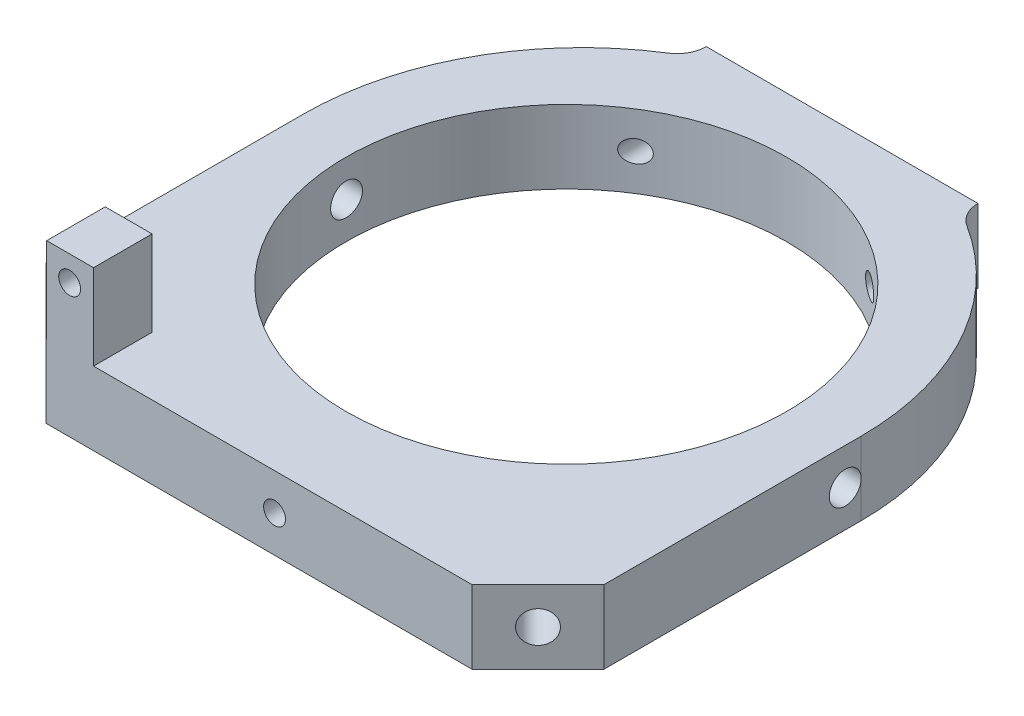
ISO-10303-21;
HEADER;
FILE_DESCRIPTION(('STEP AP214'),'2;1');
FILE_NAME('part.step','',(''),(''),'','','');
FILE_SCHEMA(('AUTOMOTIVE_DESIGN { 1 0 10303 214 1 1 1 1 }'));
ENDSEC;
DATA;
#1=APPLICATION_CONTEXT('core data for automotive mechanical design processes');
#2=APPLICATION_PROTOCOL_DEFINITION('international standard','automotive_design',2000,#1);
#3=PRODUCT_CONTEXT('',#1,'mechanical');
#4=PRODUCT('Part','Part','',(#3));
#5=PRODUCT_RELATED_PRODUCT_CATEGORY('part','',(#4));
#6=PRODUCT_DEFINITION_FORMATION('','',#4);
#7=PRODUCT_DEFINITION_CONTEXT('part definition',#1,'design');
#8=PRODUCT_DEFINITION('design','',#6,#7);
#9=PRODUCT_DEFINITION_SHAPE('','',#8);
#10=(LENGTH_UNIT() NAMED_UNIT(*) SI_UNIT(.MILLI.,.METRE.));
#11=(NAMED_UNIT(*) PLANE_ANGLE_UNIT() SI_UNIT($,.RADIAN.));
#12=(NAMED_UNIT(*) SI_UNIT($,.STERADIAN.) SOLID_ANGLE_UNIT());
#13=UNCERTAINTY_MEASURE_WITH_UNIT(LENGTH_MEASURE(1.E-05),#10,'distance_accuracy_value','');
#14=(GEOMETRIC_REPRESENTATION_CONTEXT(3) GLOBAL_UNCERTAINTY_ASSIGNED_CONTEXT((#13)) GLOBAL_UNIT_ASSIGNED_CONTEXT((#10,
#11,#12)) REPRESENTATION_CONTEXT('',''));
#15=CARTESIAN_POINT('',(0.,0.,0.));
#16=DIRECTION('',(0.,0.,1.));
#17=DIRECTION('',(1.,0.,0.));
#18=AXIS2_PLACEMENT_3D('',#15,#16,#17);
#19=CARTESIAN_POINT('',(0.,7.9502,-1.69597071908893));
#20=DIRECTION('',(0.,1.,0.));
#21=DIRECTION('',(0.,0.,1.));
#22=AXIS2_PLACEMENT_3D('',#19,#20,#21);
#23=PLANE('',#22);
#24=DIRECTION('',(0.,0.,1.));
#25=VECTOR('',#24,1.);
#26=CARTESIAN_POINT('',(-23.0378,7.9502,33.3248));
#27=LINE('',#26,#25);
#28=CARTESIAN_POINT('',(-23.0378,7.9502,26.9748));
#29=VERTEX_POINT('',#28);
#30=CARTESIAN_POINT('',(-23.0378,7.9502,33.3248));
#31=VERTEX_POINT('',#30);
#32=EDGE_CURVE('E313',#29,#31,#27,.T.);
#33=ORIENTED_EDGE('',*,*,#32,.F.);
#34=DIRECTION('',(-1.,0.,0.));
#35=VECTOR('',#34,1.);
#36=CARTESIAN_POINT('',(-23.0378,7.9502,26.9748));
#37=LINE('',#36,#35);
#38=CARTESIAN_POINT('',(-17.9578,7.9502,26.9748));
#39=VERTEX_POINT('',#38);
#40=EDGE_CURVE('E315',#39,#29,#37,.T.);
#41=ORIENTED_EDGE('',*,*,#40,.F.);
#42=DIRECTION('',(0.,0.,-1.));
#43=VECTOR('',#42,1.);
#44=CARTESIAN_POINT('',(-17.9578,7.9502,33.3248));
#45=LINE('',#44,#43);
#46=CARTESIAN_POINT('',(-17.9578,7.9502,33.3248));
#47=VERTEX_POINT('',#46);
#48=EDGE_CURVE('E279',#47,#39,#45,.T.);
#49=ORIENTED_EDGE('',*,*,#48,.F.);
#50=DIRECTION('',(1.,0.,0.));
#51=VECTOR('',#50,1.);
#52=CARTESIAN_POINT('',(23.114,7.9502,33.3248));
#53=LINE('',#52,#51);
#54=CARTESIAN_POINT('',(23.114,7.9502,33.3248));
#55=VERTEX_POINT('',#54);
#56=EDGE_CURVE('E188',#47,#55,#53,.T.);
#57=ORIENTED_EDGE('',*,*,#56,.T.);
#58=DIRECTION('',(0.707106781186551,0.,-0.707106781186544));
#59=VECTOR('',#58,1.);
#60=CARTESIAN_POINT('',(30.2514,7.9502,26.1874000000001));
#61=LINE('',#60,#59);
#62=CARTESIAN_POINT('',(30.2514,7.9502,26.1874000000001));
#63=VERTEX_POINT('',#62);
#64=EDGE_CURVE('E187',#55,#63,#61,.T.);
#65=ORIENTED_EDGE('',*,*,#64,.T.);
#66=DIRECTION('',(0.,0.,-1.));
#67=VECTOR('',#66,1.);
#68=CARTESIAN_POINT('',(30.2514,7.9502,-1.69597071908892));
#69=LINE('',#68,#67);
#70=CARTESIAN_POINT('',(30.2514,7.9502,-1.69597071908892));
#71=VERTEX_POINT('',#70);
#72=EDGE_CURVE('E197',#63,#71,#69,.T.);
#73=ORIENTED_EDGE('',*,*,#72,.T.);
#74=CARTESIAN_POINT('',(0.,7.9502,-1.69597071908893));
#75=DIRECTION('',(0.,1.,0.));
#76=DIRECTION('',(0.,0.,1.));
#77=AXIS2_PLACEMENT_3D('',#74,#75,#76);
#78=CIRCLE('',#77,30.2514);
#79=CARTESIAN_POINT('',(16.2061071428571,7.9502,-27.2402321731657));
#80=VERTEX_POINT('',#79);
#81=EDGE_CURVE('E234',#71,#80,#78,.T.);
#82=ORIENTED_EDGE('',*,*,#81,.T.);
#83=CARTESIAN_POINT('',(17.907,7.9502,-29.9212));
#84=DIRECTION('',(0.,-1.,0.));
#85=DIRECTION('',(0.,0.,1.));
#86=AXIS2_PLACEMENT_3D('',#83,#84,#85);
#87=CIRCLE('',#86,3.175);
#88=CARTESIAN_POINT('',(14.732,7.9502,-29.9212));
#89=VERTEX_POINT('',#88);
#90=EDGE_CURVE('E264',#80,#89,#87,.T.);
#91=ORIENTED_EDGE('',*,*,#90,.T.);
#92=DIRECTION('',(-1.,0.,0.));
#93=VECTOR('',#92,1.);
#94=CARTESIAN_POINT('',(14.732,7.9502,-29.9212));
#95=LINE('',#94,#93);
#96=CARTESIAN_POINT('',(-14.732,7.9502,-29.9212));
#97=VERTEX_POINT('',#96);
#98=EDGE_CURVE('E266',#89,#97,#95,.T.);
#99=ORIENTED_EDGE('',*,*,#98,.T.);
#100=CARTESIAN_POINT('',(-17.907,7.9502,-29.9212));
#101=DIRECTION('',(0.,-1.,0.));
#102=DIRECTION('',(0.,0.,-1.));
#103=AXIS2_PLACEMENT_3D('',#100,#101,#102);
#104=CIRCLE('',#103,3.175);
#105=CARTESIAN_POINT('',(-16.2061071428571,7.9502,-27.2402321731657));
#106=VERTEX_POINT('',#105);
#107=EDGE_CURVE('E268',#97,#106,#104,.T.);
#108=ORIENTED_EDGE('',*,*,#107,.T.);
#109=CARTESIAN_POINT('',(0.,7.9502,-1.69597071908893));
#110=DIRECTION('',(0.,1.,0.));
#111=DIRECTION('',(0.,0.,-1.));
#112=AXIS2_PLACEMENT_3D('',#109,#110,#111);
#113=CIRCLE('',#112,30.2514);
#114=CARTESIAN_POINT('',(-30.2514,7.9502,-1.69597071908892));
#115=VERTEX_POINT('',#114);
#116=EDGE_CURVE('E270',#106,#115,#113,.T.);
#117=ORIENTED_EDGE('',*,*,#116,.T.);
#118=DIRECTION('',(0.,0.,1.));
#119=VECTOR('',#118,1.);
#120=CARTESIAN_POINT('',(-30.2514,7.9502,-1.69597071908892));
#121=LINE('',#120,#119);
#122=CARTESIAN_POINT('',(-30.2514,7.9502,26.1874000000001));
#123=VERTEX_POINT('',#122);
#124=EDGE_CURVE('E164',#115,#123,#121,.T.);
#125=ORIENTED_EDGE('',*,*,#124,.T.);
#126=DIRECTION('',(0.707106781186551,0.,0.707106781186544));
#127=VECTOR('',#126,1.);
#128=CARTESIAN_POINT('',(-30.2514,7.9502,26.1874000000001));
#129=LINE('',#128,#127);
#130=CARTESIAN_POINT('',(-23.114,7.9502,33.3248));
#131=VERTEX_POINT('',#130);
#132=EDGE_CURVE('E193',#123,#131,#129,.T.);
#133=ORIENTED_EDGE('',*,*,#132,.T.);
#134=EDGE_CURVE('E184',#131,#31,#53,.T.);
#135=ORIENTED_EDGE('',*,*,#134,.T.);
#136=EDGE_LOOP('',(#33,#41,#49,#57,#65,#73,#82,#91,#99,#108,#117,#125,#133,#135));
#137=FACE_BOUND('',#136,.T.);
#138=CARTESIAN_POINT('',(0.,7.9502,0.));
#139=DIRECTION('',(0.,1.,0.));
#140=DIRECTION('',(0.,0.,1.));
#141=AXIS2_PLACEMENT_3D('',#138,#139,#140);
#142=CIRCLE('',#141,23.9014);
#143=CARTESIAN_POINT('',(0.,7.9502,23.9014));
#144=VERTEX_POINT('',#143);
#145=EDGE_CURVE('E241',#144,#144,#142,.T.);
#146=ORIENTED_EDGE('',*,*,#145,.F.);
#147=EDGE_LOOP('',(#146));
#148=FACE_BOUND('',#147,.T.);
#149=ADVANCED_FACE('F28',(#137,#148),#23,.T.);
#150=CARTESIAN_POINT('',(0.,0.,-1.69597071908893));
#151=DIRECTION('',(0.,1.,0.));
#152=DIRECTION('',(0.,0.,1.));
#153=AXIS2_PLACEMENT_3D('',#150,#151,#152);
#154=PLANE('',#153);
#155=CARTESIAN_POINT('',(0.,0.,-1.69597071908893));
#156=DIRECTION('',(0.,1.,0.));
#157=DIRECTION('',(0.,0.,1.));
#158=AXIS2_PLACEMENT_3D('',#155,#156,#157);
#159=CIRCLE('',#158,30.2514);
#160=CARTESIAN_POINT('',(30.2514,0.,-1.69597071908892));
#161=VERTEX_POINT('',#160);
#162=CARTESIAN_POINT('',(16.2061071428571,0.,-27.2402321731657));
#163=VERTEX_POINT('',#162);
#164=EDGE_CURVE('E225',#161,#163,#159,.T.);
#165=ORIENTED_EDGE('',*,*,#164,.F.);
#166=DIRECTION('',(0.,0.,-1.));
#167=VECTOR('',#166,1.);
#168=CARTESIAN_POINT('',(30.2514,0.,-1.69597071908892));
#169=LINE('',#168,#167);
#170=CARTESIAN_POINT('',(30.2514,0.,26.1874000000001));
#171=VERTEX_POINT('',#170);
#172=EDGE_CURVE('E228',#171,#161,#169,.T.);
#173=ORIENTED_EDGE('',*,*,#172,.F.);
#174=DIRECTION('',(0.707106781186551,0.,-0.707106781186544));
#175=VECTOR('',#174,1.);
#176=CARTESIAN_POINT('',(30.2514,0.,26.1874000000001));
#177=LINE('',#176,#175);
#178=CARTESIAN_POINT('',(23.114,0.,33.3248));
#179=VERTEX_POINT('',#178);
#180=EDGE_CURVE('E235',#179,#171,#177,.T.);
#181=ORIENTED_EDGE('',*,*,#180,.F.);
#182=DIRECTION('',(1.,0.,0.));
#183=VECTOR('',#182,1.);
#184=CARTESIAN_POINT('',(23.114,0.,33.3248));
#185=LINE('',#184,#183);
#186=CARTESIAN_POINT('',(-23.114,0.,33.3248));
#187=VERTEX_POINT('',#186);
#188=EDGE_CURVE('E259',#187,#179,#185,.T.);
#189=ORIENTED_EDGE('',*,*,#188,.F.);
#190=DIRECTION('',(0.707106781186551,0.,0.707106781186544));
#191=VECTOR('',#190,1.);
#192=CARTESIAN_POINT('',(-30.2514,0.,26.1874000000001));
#193=LINE('',#192,#191);
#194=CARTESIAN_POINT('',(-30.2514,0.,26.1874000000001));
#195=VERTEX_POINT('',#194);
#196=EDGE_CURVE('E257',#195,#187,#193,.T.);
#197=ORIENTED_EDGE('',*,*,#196,.F.);
#198=DIRECTION('',(0.,0.,1.));
#199=VECTOR('',#198,1.);
#200=CARTESIAN_POINT('',(-30.2514,0.,-1.69597071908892));
#201=LINE('',#200,#199);
#202=CARTESIAN_POINT('',(-30.2514,0.,-1.69597071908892));
#203=VERTEX_POINT('',#202);
#204=EDGE_CURVE('E255',#203,#195,#201,.T.);
#205=ORIENTED_EDGE('',*,*,#204,.F.);
#206=CARTESIAN_POINT('',(0.,0.,-1.69597071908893));
#207=DIRECTION('',(0.,1.,0.));
#208=DIRECTION('',(0.,0.,-1.));
#209=AXIS2_PLACEMENT_3D('',#206,#207,#208);
#210=CIRCLE('',#209,30.2514);
#211=CARTESIAN_POINT('',(-16.2061071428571,0.,-27.2402321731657));
#212=VERTEX_POINT('',#211);
#213=EDGE_CURVE('E253',#212,#203,#210,.T.);
#214=ORIENTED_EDGE('',*,*,#213,.F.);
#215=CARTESIAN_POINT('',(-17.907,0.,-29.9212));
#216=DIRECTION('',(0.,-1.,0.));
#217=DIRECTION('',(0.,0.,-1.));
#218=AXIS2_PLACEMENT_3D('',#215,#216,#217);
#219=CIRCLE('',#218,3.175);
#220=CARTESIAN_POINT('',(-14.732,0.,-29.9212));
#221=VERTEX_POINT('',#220);
#222=EDGE_CURVE('E251',#221,#212,#219,.T.);
#223=ORIENTED_EDGE('',*,*,#222,.F.);
#224=DIRECTION('',(-1.,0.,0.));
#225=VECTOR('',#224,1.);
#226=CARTESIAN_POINT('',(14.732,0.,-29.9212));
#227=LINE('',#226,#225);
#228=CARTESIAN_POINT('',(14.732,0.,-29.9212));
#229=VERTEX_POINT('',#228);
#230=EDGE_CURVE('E243',#229,#221,#227,.T.);
#231=ORIENTED_EDGE('',*,*,#230,.F.);
#232=CARTESIAN_POINT('',(17.907,0.,-29.9212));
#233=DIRECTION('',(0.,-1.,0.));
#234=DIRECTION('',(0.,0.,1.));
#235=AXIS2_PLACEMENT_3D('',#232,#233,#234);
#236=CIRCLE('',#235,3.175);
#237=EDGE_CURVE('E240',#163,#229,#236,.T.);
#238=ORIENTED_EDGE('',*,*,#237,.F.);
#239=EDGE_LOOP('',(#165,#173,#181,#189,#197,#205,#214,#223,#231,#238));
#240=FACE_BOUND('',#239,.T.);
#241=CARTESIAN_POINT('',(0.,0.,0.));
#242=DIRECTION('',(0.,1.,0.));
#243=DIRECTION('',(0.,0.,1.));
#244=AXIS2_PLACEMENT_3D('',#241,#242,#243);
#245=CIRCLE('',#244,23.9014);
#246=CARTESIAN_POINT('',(0.,0.,23.9014));
#247=VERTEX_POINT('',#246);
#248=EDGE_CURVE('E246',#247,#247,#245,.T.);
#249=ORIENTED_EDGE('',*,*,#248,.T.);
#250=EDGE_LOOP('',(#249));
#251=FACE_BOUND('',#250,.T.);
#252=ADVANCED_FACE('F237',(#240,#251),#154,.F.);
#253=CARTESIAN_POINT('',(0.,7.9502,-1.69597071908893));
#254=DIRECTION('',(0.,-1.,0.));
#255=DIRECTION('',(0.,0.,-1.));
#256=AXIS2_PLACEMENT_3D('',#253,#254,#255);
#257=CYLINDRICAL_SURFACE('',#256,30.2514);
#258=DIRECTION('',(0.,-1.,0.));
#259=VECTOR('',#258,1.);
#260=CARTESIAN_POINT('',(30.2514,7.9502,-1.69597071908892));
#261=LINE('',#260,#259);
#262=CARTESIAN_POINT('',(30.2514,4.30206048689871,-1.69597071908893));
#263=VERTEX_POINT('',#262);
#264=EDGE_CURVE('E206',#71,#263,#261,.T.);
#265=ORIENTED_EDGE('',*,*,#264,.T.);
#266=CARTESIAN_POINT('',(30.2514,3.9751,0.));
#267=DIRECTION('',(1.,0.,0.));
#268=DIRECTION('',(0.,-0.189300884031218,-0.981919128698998));
#269=AXIS2_PLACEMENT_3D('',#266,#267,#268);
#270=CIRCLE('',#269,1.72720000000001);
#271=CARTESIAN_POINT('',(30.2514,3.64813951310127,-1.69597071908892));
#272=VERTEX_POINT('',#271);
#273=EDGE_CURVE('E158',#272,#263,#270,.T.);
#274=ORIENTED_EDGE('',*,*,#273,.F.);
#275=EDGE_CURVE('E199',#272,#161,#261,.T.);
#276=ORIENTED_EDGE('',*,*,#275,.T.);
#277=ORIENTED_EDGE('',*,*,#164,.T.);
#278=DIRECTION('',(0.,-1.,0.));
#279=VECTOR('',#278,1.);
#280=CARTESIAN_POINT('',(16.2061071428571,7.9502,-27.2402321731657));
#281=LINE('',#280,#279);
#282=EDGE_CURVE('E11',#80,#163,#281,.T.);
#283=ORIENTED_EDGE('',*,*,#282,.F.);
#284=ORIENTED_EDGE('',*,*,#81,.F.);
#285=EDGE_LOOP('',(#265,#274,#276,#277,#283,#284));
#286=FACE_BOUND('',#285,.T.);
#287=ADVANCED_FACE('F30',(#286),#257,.T.);
#288=CARTESIAN_POINT('',(17.907,7.9502,-29.9212));
#289=DIRECTION('',(0.,-1.,0.));
#290=DIRECTION('',(0.,0.,-1.));
#291=AXIS2_PLACEMENT_3D('',#288,#289,#290);
#292=CYLINDRICAL_SURFACE('',#291,3.175);
#293=ORIENTED_EDGE('',*,*,#237,.T.);
#294=DIRECTION('',(0.,-1.,0.));
#295=VECTOR('',#294,1.);
#296=CARTESIAN_POINT('',(14.732,7.9502,-29.9212));
#297=LINE('',#296,#295);
#298=EDGE_CURVE('E38',#89,#229,#297,.T.);
#299=ORIENTED_EDGE('',*,*,#298,.F.);
#300=ORIENTED_EDGE('',*,*,#90,.F.);
#301=ORIENTED_EDGE('',*,*,#282,.T.);
#302=EDGE_LOOP('',(#293,#299,#300,#301));
#303=FACE_BOUND('',#302,.T.);
#304=ADVANCED_FACE('F292',(#303),#292,.F.);
#305=CARTESIAN_POINT('',(14.732,7.9502,-29.9212));
#306=DIRECTION('',(0.,0.,1.));
#307=DIRECTION('',(1.,0.,0.));
#308=AXIS2_PLACEMENT_3D('',#305,#306,#307);
#309=PLANE('',#308);
#310=CARTESIAN_POINT('',(-12.7,3.9751,-29.9212));
#311=DIRECTION('',(0.,0.,-1.));
#312=DIRECTION('',(1.,0.,0.));
#313=AXIS2_PLACEMENT_3D('',#310,#311,#312);
#314=CIRCLE('',#313,1.18745);
#315=CARTESIAN_POINT('',(-11.51255,3.9751,-29.9212));
#316=VERTEX_POINT('',#315);
#317=EDGE_CURVE('E599',#316,#316,#314,.T.);
#318=ORIENTED_EDGE('',*,*,#317,.F.);
#319=EDGE_LOOP('',(#318));
#320=FACE_BOUND('',#319,.T.);
#321=CARTESIAN_POINT('',(12.7,3.9751,-29.9212));
#322=DIRECTION('',(0.,0.,-1.));
#323=DIRECTION('',(-1.,0.,0.));
#324=AXIS2_PLACEMENT_3D('',#321,#322,#323);
#325=CIRCLE('',#324,1.18745);
#326=CARTESIAN_POINT('',(11.51255,3.9751,-29.9212));
#327=VERTEX_POINT('',#326);
#328=EDGE_CURVE('E601',#327,#327,#325,.T.);
#329=ORIENTED_EDGE('',*,*,#328,.F.);
#330=EDGE_LOOP('',(#329));
#331=FACE_BOUND('',#330,.T.);
#332=ORIENTED_EDGE('',*,*,#230,.T.);
#333=DIRECTION('',(0.,-1.,0.));
#334=VECTOR('',#333,1.);
#335=CARTESIAN_POINT('',(-14.732,7.9502,-29.9212));
#336=LINE('',#335,#334);
#337=EDGE_CURVE('E168',#97,#221,#336,.T.);
#338=ORIENTED_EDGE('',*,*,#337,.F.);
#339=ORIENTED_EDGE('',*,*,#98,.F.);
#340=ORIENTED_EDGE('',*,*,#298,.T.);
#341=EDGE_LOOP('',(#332,#338,#339,#340));
#342=FACE_BOUND('',#341,.T.);
#343=ADVANCED_FACE('F296',(#320,#331,#342),#309,.F.);
#344=CARTESIAN_POINT('',(-17.907,7.9502,-29.9212));
#345=DIRECTION('',(0.,-1.,0.));
#346=DIRECTION('',(0.,0.,-1.));
#347=AXIS2_PLACEMENT_3D('',#344,#345,#346);
#348=CYLINDRICAL_SURFACE('',#347,3.175);
#349=ORIENTED_EDGE('',*,*,#222,.T.);
#350=DIRECTION('',(0.,-1.,0.));
#351=VECTOR('',#350,1.);
#352=CARTESIAN_POINT('',(-16.2061071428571,7.9502,-27.2402321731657));
#353=LINE('',#352,#351);
#354=EDGE_CURVE('E165',#106,#212,#353,.T.);
#355=ORIENTED_EDGE('',*,*,#354,.F.);
#356=ORIENTED_EDGE('',*,*,#107,.F.);
#357=ORIENTED_EDGE('',*,*,#337,.T.);
#358=EDGE_LOOP('',(#349,#355,#356,#357));
#359=FACE_BOUND('',#358,.T.);
#360=ADVANCED_FACE('F300',(#359),#348,.F.);
#361=CARTESIAN_POINT('',(0.,7.9502,-1.69597071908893));
#362=DIRECTION('',(0.,-1.,0.));
#363=DIRECTION('',(0.,0.,-1.));
#364=AXIS2_PLACEMENT_3D('',#361,#362,#363);
#365=CYLINDRICAL_SURFACE('',#364,30.2514);
#366=DIRECTION('',(0.,-1.,0.));
#367=VECTOR('',#366,1.);
#368=CARTESIAN_POINT('',(-30.2514,7.9502,-1.69597071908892));
#369=LINE('',#368,#367);
#370=CARTESIAN_POINT('',(-30.2514,3.64813951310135,-1.69597071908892));
#371=VERTEX_POINT('',#370);
#372=EDGE_CURVE('E157',#371,#203,#369,.T.);
#373=ORIENTED_EDGE('',*,*,#372,.F.);
#374=CARTESIAN_POINT('',(-30.2514,3.64813951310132,-1.69597071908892));
#375=CARTESIAN_POINT('',(-30.251399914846,3.67508619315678,-1.7011678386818));
#376=CARTESIAN_POINT('',(-30.2513986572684,3.70215669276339,-1.70572450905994));
#377=CARTESIAN_POINT('',(-30.2513951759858,3.75642232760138,-1.71353367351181));
#378=CARTESIAN_POINT('',(-30.251392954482,3.78361703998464,-1.7167891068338));
#379=CARTESIAN_POINT('',(-30.2513889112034,3.83813108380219,-1.72199625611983));
#380=CARTESIAN_POINT('',(-30.2513870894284,3.86545041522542,-1.72394797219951));
#381=CARTESIAN_POINT('',(-30.251384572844,3.92021307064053,-1.7265513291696));
#382=CARTESIAN_POINT('',(-30.2513838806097,3.94765653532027,-1.72719999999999));
#383=CARTESIAN_POINT('',(-30.2513838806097,4.00254346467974,-1.72719999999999));
#384=CARTESIAN_POINT('',(-30.251384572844,4.02998692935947,-1.7265513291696));
#385=CARTESIAN_POINT('',(-30.2513870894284,4.08474958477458,-1.72394797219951));
#386=CARTESIAN_POINT('',(-30.2513889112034,4.11206891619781,-1.72199625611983));
#387=CARTESIAN_POINT('',(-30.251392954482,4.16658296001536,-1.7167891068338));
#388=CARTESIAN_POINT('',(-30.2513951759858,4.19377767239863,-1.71353367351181));
#389=CARTESIAN_POINT('',(-30.2513986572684,4.24804330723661,-1.70572450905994));
#390=CARTESIAN_POINT('',(-30.251399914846,4.27511380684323,-1.7011678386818));
#391=CARTESIAN_POINT('',(-30.2514,4.30206048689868,-1.69597071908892));
#392=B_SPLINE_CURVE_WITH_KNOTS('',3,(#374,#375,#376,#377,#378,#379,#380,#381,#382,#383,#384,
#385,#386,#387,#388,#389,#390,#391),.UNSPECIFIED.,.F.,.F.,(4,2,2,2,2,2,2,2,4),(0.,
0.0823225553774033,0.164458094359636,0.246593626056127,0.328916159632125,0.411238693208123,
0.493374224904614,0.575509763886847,0.657832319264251),.UNSPECIFIED.);
#393=CARTESIAN_POINT('',(-30.2514,4.30206048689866,-1.69597071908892));
#394=VERTEX_POINT('',#393);
#395=EDGE_CURVE('E52',#371,#394,#392,.T.);
#396=ORIENTED_EDGE('',*,*,#395,.T.);
#397=EDGE_CURVE('E154',#115,#394,#369,.T.);
#398=ORIENTED_EDGE('',*,*,#397,.F.);
#399=ORIENTED_EDGE('',*,*,#116,.F.);
#400=ORIENTED_EDGE('',*,*,#354,.T.);
#401=ORIENTED_EDGE('',*,*,#213,.T.);
#402=EDGE_LOOP('',(#373,#396,#398,#399,#400,#401));
#403=FACE_BOUND('',#402,.T.);
#404=ADVANCED_FACE('F152',(#403),#365,.T.);
#405=CARTESIAN_POINT('',(-30.2514,7.9502,-1.69597071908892));
#406=DIRECTION('',(1.,0.,0.));
#407=DIRECTION('',(0.,0.,-1.));
#408=AXIS2_PLACEMENT_3D('',#405,#406,#407);
#409=PLANE('',#408);
#410=ORIENTED_EDGE('',*,*,#397,.T.);
#411=CARTESIAN_POINT('',(-30.2514,3.9751,0.));
#412=DIRECTION('',(1.,0.,0.));
#413=DIRECTION('',(0.,0.,-1.));
#414=AXIS2_PLACEMENT_3D('',#411,#412,#413);
#415=CIRCLE('',#414,1.72720000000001);
#416=EDGE_CURVE('E142',#394,#371,#415,.T.);
#417=ORIENTED_EDGE('',*,*,#416,.T.);
#418=ORIENTED_EDGE('',*,*,#372,.T.);
#419=ORIENTED_EDGE('',*,*,#204,.T.);
#420=DIRECTION('',(0.,-1.,0.));
#421=VECTOR('',#420,1.);
#422=CARTESIAN_POINT('',(-30.2514,7.9502,26.1874000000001));
#423=LINE('',#422,#421);
#424=EDGE_CURVE('E170',#123,#195,#423,.T.);
#425=ORIENTED_EDGE('',*,*,#424,.F.);
#426=ORIENTED_EDGE('',*,*,#124,.F.);
#427=EDGE_LOOP('',(#410,#417,#418,#419,#425,#426));
#428=FACE_BOUND('',#427,.T.);
#429=ADVANCED_FACE('F162',(#428),#409,.F.);
#430=CARTESIAN_POINT('',(-30.2514,7.9502,26.1874000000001));
#431=DIRECTION('',(0.707106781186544,0.,-0.707106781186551));
#432=DIRECTION('',(-0.707106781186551,0.,-0.707106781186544));
#433=AXIS2_PLACEMENT_3D('',#430,#431,#432);
#434=PLANE('',#433);
#435=CARTESIAN_POINT('',(-26.6827,3.9751,29.7561));
#436=DIRECTION('',(-0.707106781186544,0.,0.707106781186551));
#437=DIRECTION('',(0.707106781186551,0.,0.707106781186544));
#438=AXIS2_PLACEMENT_3D('',#435,#436,#437);
#439=CIRCLE('',#438,1.7272);
#440=CARTESIAN_POINT('',(-25.4613851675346,3.9751,30.9774148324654));
#441=VERTEX_POINT('',#440);
#442=EDGE_CURVE('E622',#441,#441,#439,.T.);
#443=ORIENTED_EDGE('',*,*,#442,.F.);
#444=EDGE_LOOP('',(#443));
#445=FACE_BOUND('',#444,.T.);
#446=ORIENTED_EDGE('',*,*,#196,.T.);
#447=DIRECTION('',(0.,-1.,0.));
#448=VECTOR('',#447,1.);
#449=CARTESIAN_POINT('',(-23.114,7.9502,33.3248));
#450=LINE('',#449,#448);
#451=EDGE_CURVE('E288',#131,#187,#450,.T.);
#452=ORIENTED_EDGE('',*,*,#451,.F.);
#453=ORIENTED_EDGE('',*,*,#132,.F.);
#454=ORIENTED_EDGE('',*,*,#424,.T.);
#455=EDGE_LOOP('',(#446,#452,#453,#454));
#456=FACE_BOUND('',#455,.T.);
#457=ADVANCED_FACE('F307',(#445,#456),#434,.F.);
#458=CARTESIAN_POINT('',(23.114,7.9502,33.3248));
#459=DIRECTION('',(0.,0.,-1.));
#460=DIRECTION('',(-1.,0.,0.));
#461=AXIS2_PLACEMENT_3D('',#458,#459,#460);
#462=PLANE('',#461);
#463=CARTESIAN_POINT('',(-20.5486,14.478,33.3248));
#464=DIRECTION('',(0.,0.,1.));
#465=DIRECTION('',(1.,0.,0.));
#466=AXIS2_PLACEMENT_3D('',#463,#464,#465);
#467=CIRCLE('',#466,1.18745);
#468=CARTESIAN_POINT('',(-19.36115,14.478,33.3248));
#469=VERTEX_POINT('',#468);
#470=EDGE_CURVE('E700',#469,#469,#467,.T.);
#471=ORIENTED_EDGE('',*,*,#470,.F.);
#472=EDGE_LOOP('',(#471));
#473=FACE_BOUND('',#472,.T.);
#474=CARTESIAN_POINT('',(1.67639999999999,3.9751,33.3248));
#475=DIRECTION('',(0.,0.,1.));
#476=DIRECTION('',(1.,0.,0.));
#477=AXIS2_PLACEMENT_3D('',#474,#475,#476);
#478=CIRCLE('',#477,1.18745);
#479=CARTESIAN_POINT('',(2.86384999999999,3.9751,33.3248));
#480=VERTEX_POINT('',#479);
#481=EDGE_CURVE('E610',#480,#480,#478,.T.);
#482=ORIENTED_EDGE('',*,*,#481,.F.);
#483=EDGE_LOOP('',(#482));
#484=FACE_BOUND('',#483,.T.);
#485=ORIENTED_EDGE('',*,*,#188,.T.);
#486=DIRECTION('',(0.,-1.,0.));
#487=VECTOR('',#486,1.);
#488=CARTESIAN_POINT('',(23.114,7.9502,33.3248));
#489=LINE('',#488,#487);
#490=EDGE_CURVE('E219',#55,#179,#489,.T.);
#491=ORIENTED_EDGE('',*,*,#490,.F.);
#492=ORIENTED_EDGE('',*,*,#56,.F.);
#493=DIRECTION('',(0.,-1.,0.));
#494=VECTOR('',#493,1.);
#495=CARTESIAN_POINT('',(-17.9578,17.1958,33.3248));
#496=LINE('',#495,#494);
#497=CARTESIAN_POINT('',(-17.9578,17.1958,33.3248));
#498=VERTEX_POINT('',#497);
#499=EDGE_CURVE('E334',#498,#47,#496,.T.);
#500=ORIENTED_EDGE('',*,*,#499,.F.);
#501=DIRECTION('',(1.,0.,0.));
#502=VECTOR('',#501,1.);
#503=CARTESIAN_POINT('',(-23.0378,17.1958,33.3248));
#504=LINE('',#503,#502);
#505=CARTESIAN_POINT('',(-23.0378,17.1958,33.3248));
#506=VERTEX_POINT('',#505);
#507=EDGE_CURVE('E359',#506,#498,#504,.T.);
#508=ORIENTED_EDGE('',*,*,#507,.F.);
#509=DIRECTION('',(0.,-1.,0.));
#510=VECTOR('',#509,1.);
#511=CARTESIAN_POINT('',(-23.0378,17.1958,33.3248));
#512=LINE('',#511,#510);
#513=EDGE_CURVE('E311',#506,#31,#512,.T.);
#514=ORIENTED_EDGE('',*,*,#513,.T.);
#515=ORIENTED_EDGE('',*,*,#134,.F.);
#516=ORIENTED_EDGE('',*,*,#451,.T.);
#517=EDGE_LOOP('',(#485,#491,#492,#500,#508,#514,#515,#516));
#518=FACE_BOUND('',#517,.T.);
#519=ADVANCED_FACE('F284',(#473,#484,#518),#462,.F.);
#520=CARTESIAN_POINT('',(30.2514,7.9502,26.1874000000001));
#521=DIRECTION('',(-0.707106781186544,0.,-0.707106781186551));
#522=DIRECTION('',(-0.707106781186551,0.,0.707106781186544));
#523=AXIS2_PLACEMENT_3D('',#520,#521,#522);
#524=PLANE('',#523);
#525=CARTESIAN_POINT('',(26.6827,3.9751,29.7561));
#526=DIRECTION('',(0.707106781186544,0.,0.707106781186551));
#527=DIRECTION('',(0.707106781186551,0.,-0.707106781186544));
#528=AXIS2_PLACEMENT_3D('',#525,#526,#527);
#529=CIRCLE('',#528,1.7272);
#530=CARTESIAN_POINT('',(27.9040148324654,3.9751,28.5347851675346));
#531=VERTEX_POINT('',#530);
#532=EDGE_CURVE('E631',#531,#531,#529,.T.);
#533=ORIENTED_EDGE('',*,*,#532,.F.);
#534=EDGE_LOOP('',(#533));
#535=FACE_BOUND('',#534,.T.);
#536=ORIENTED_EDGE('',*,*,#180,.T.);
#537=DIRECTION('',(0.,-1.,0.));
#538=VECTOR('',#537,1.);
#539=CARTESIAN_POINT('',(30.2514,7.9502,26.1874000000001));
#540=LINE('',#539,#538);
#541=EDGE_CURVE('E202',#63,#171,#540,.T.);
#542=ORIENTED_EDGE('',*,*,#541,.F.);
#543=ORIENTED_EDGE('',*,*,#64,.F.);
#544=ORIENTED_EDGE('',*,*,#490,.T.);
#545=EDGE_LOOP('',(#536,#542,#543,#544));
#546=FACE_BOUND('',#545,.T.);
#547=ADVANCED_FACE('F289',(#535,#546),#524,.F.);
#548=CARTESIAN_POINT('',(30.2514,7.9502,-1.69597071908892));
#549=DIRECTION('',(-1.,0.,0.));
#550=DIRECTION('',(0.,0.,1.));
#551=AXIS2_PLACEMENT_3D('',#548,#549,#550);
#552=PLANE('',#551);
#553=ORIENTED_EDGE('',*,*,#275,.F.);
#554=CARTESIAN_POINT('',(30.2514,3.9751,0.));
#555=DIRECTION('',(1.,0.,0.));
#556=DIRECTION('',(0.,0.,-1.));
#557=AXIS2_PLACEMENT_3D('',#554,#555,#556);
#558=CIRCLE('',#557,1.72720000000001);
#559=EDGE_CURVE('E45',#263,#272,#558,.T.);
#560=ORIENTED_EDGE('',*,*,#559,.F.);
#561=ORIENTED_EDGE('',*,*,#264,.F.);
#562=ORIENTED_EDGE('',*,*,#72,.F.);
#563=ORIENTED_EDGE('',*,*,#541,.T.);
#564=ORIENTED_EDGE('',*,*,#172,.T.);
#565=EDGE_LOOP('',(#553,#560,#561,#562,#563,#564));
#566=FACE_BOUND('',#565,.T.);
#567=ADVANCED_FACE('F229',(#566),#552,.F.);
#568=CARTESIAN_POINT('',(0.,7.9502,0.));
#569=DIRECTION('',(0.,-1.,0.));
#570=DIRECTION('',(0.,0.,-1.));
#571=AXIS2_PLACEMENT_3D('',#568,#569,#570);
#572=CYLINDRICAL_SURFACE('',#571,23.9014);
#573=CARTESIAN_POINT('',(-13.88745,3.9751,-19.4529086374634));
#574=CARTESIAN_POINT('',(-13.8874488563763,4.033126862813,-19.4529095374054));
#575=CARTESIAN_POINT('',(-13.8831717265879,4.09116257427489,-19.4559650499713));
#576=CARTESIAN_POINT('',(-13.8663360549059,4.20539446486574,-19.4679672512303));
#577=CARTESIAN_POINT('',(-13.8537737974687,4.26158980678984,-19.4769165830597));
#578=CARTESIAN_POINT('',(-13.8211791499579,4.37032797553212,-19.5000595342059));
#579=CARTESIAN_POINT('',(-13.8011784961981,4.42288521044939,-19.5142308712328));
#580=CARTESIAN_POINT('',(-13.7546818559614,4.52351564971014,-19.5470318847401));
#581=CARTESIAN_POINT('',(-13.7281842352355,4.57158772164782,-19.5656626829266));
#582=CARTESIAN_POINT('',(-13.6676026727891,4.66585742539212,-19.6080345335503));
#583=CARTESIAN_POINT('',(-13.6331080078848,4.71166649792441,-19.632048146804));
#584=CARTESIAN_POINT('',(-13.559013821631,4.79688178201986,-19.683294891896));
#585=CARTESIAN_POINT('',(-13.5194120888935,4.83628520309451,-19.710529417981));
#586=CARTESIAN_POINT('',(-13.4286815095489,4.91492915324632,-19.7724798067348));
#587=CARTESIAN_POINT('',(-13.3767571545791,4.95288359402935,-19.8076630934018));
#588=CARTESIAN_POINT('',(-13.2686545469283,5.01946865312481,-19.880240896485));
#589=CARTESIAN_POINT('',(-13.2124734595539,5.0480929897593,-19.9176368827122));
#590=CARTESIAN_POINT('',(-13.0875239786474,5.09989229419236,-20.0000026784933));
#591=CARTESIAN_POINT('',(-13.018208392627,5.12138836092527,-20.0452039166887));
#592=CARTESIAN_POINT('',(-12.8771353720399,5.15147919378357,-20.1361208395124));
#593=CARTESIAN_POINT('',(-12.8053765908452,5.16006672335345,-20.1818367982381));
#594=CARTESIAN_POINT('',(-12.654747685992,5.16428041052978,-20.276658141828));
#595=CARTESIAN_POINT('',(-12.5758054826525,5.1587046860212,-20.3257094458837));
#596=CARTESIAN_POINT('',(-12.4193171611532,5.13162871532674,-20.4217019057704));
#597=CARTESIAN_POINT('',(-12.3417712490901,5.11012613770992,-20.4686427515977));
#598=CARTESIAN_POINT('',(-12.1929565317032,5.05173824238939,-20.557627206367));
#599=CARTESIAN_POINT('',(-12.1215720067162,5.01530709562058,-20.5997720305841));
#600=CARTESIAN_POINT('',(-11.9857587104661,4.92716702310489,-20.6790880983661));
#601=CARTESIAN_POINT('',(-11.9213237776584,4.87547178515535,-20.716263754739));
#602=CARTESIAN_POINT('',(-11.8102896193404,4.76491802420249,-20.7797394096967));
#603=CARTESIAN_POINT('',(-11.7624701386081,4.70773600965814,-20.8068158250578));
#604=CARTESIAN_POINT('',(-11.6775433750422,4.58358405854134,-20.8545986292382));
#605=CARTESIAN_POINT('',(-11.6404219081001,4.51662726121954,-20.8753134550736));
#606=CARTESIAN_POINT('',(-11.5839040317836,4.38579198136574,-20.9067209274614));
#607=CARTESIAN_POINT('',(-11.5626897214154,4.32294387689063,-20.9184475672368));
#608=CARTESIAN_POINT('',(-11.5309791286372,4.19381296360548,-20.9359446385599));
#609=CARTESIAN_POINT('',(-11.5204745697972,4.12753284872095,-20.9417196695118));
#610=CARTESIAN_POINT('',(-11.5113037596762,4.00077305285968,-20.9467617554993));
#611=CARTESIAN_POINT('',(-11.5115358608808,3.94039404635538,-20.9466344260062));
#612=CARTESIAN_POINT('',(-11.5211134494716,3.82059516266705,-20.9413680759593));
#613=CARTESIAN_POINT('',(-11.5304569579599,3.76117508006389,-20.9362301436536));
#614=CARTESIAN_POINT('',(-11.5574726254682,3.64636278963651,-20.9213282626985));
#615=CARTESIAN_POINT('',(-11.5749466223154,3.59090913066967,-20.9116743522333));
#616=CARTESIAN_POINT('',(-11.6173711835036,3.48391132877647,-20.8881352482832));
#617=CARTESIAN_POINT('',(-11.6423228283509,3.43236775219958,-20.8742494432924));
#618=CARTESIAN_POINT('',(-11.7001531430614,3.33176601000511,-20.8418925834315));
#619=CARTESIAN_POINT('',(-11.733369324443,3.28296598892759,-20.8232248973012));
#620=CARTESIAN_POINT('',(-11.8057294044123,3.19170140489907,-20.7822857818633));
#621=CARTESIAN_POINT('',(-11.8448754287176,3.14923912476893,-20.7600130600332));
#622=CARTESIAN_POINT('',(-11.9322209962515,3.06707232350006,-20.7099447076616));
#623=CARTESIAN_POINT('',(-11.9809395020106,3.02812450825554,-20.6818148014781));
#624=CARTESIAN_POINT('',(-12.0825673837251,2.9589310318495,-20.6226077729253));
#625=CARTESIAN_POINT('',(-12.1354787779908,2.92868959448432,-20.5915292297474));
#626=CARTESIAN_POINT('',(-12.2513754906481,2.87354635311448,-20.5228124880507));
#627=CARTESIAN_POINT('',(-12.3147637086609,2.84989293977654,-20.4848520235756));
#628=CARTESIAN_POINT('',(-12.4434581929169,2.81376581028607,-20.4069336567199));
#629=CARTESIAN_POINT('',(-12.5087653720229,2.80129750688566,-20.3669747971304));
#630=CARTESIAN_POINT('',(-12.6480642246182,2.78647024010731,-20.2808013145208));
#631=CARTESIAN_POINT('',(-12.7221174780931,2.785575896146,-20.2344308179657));
#632=CARTESIAN_POINT('',(-12.8689667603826,2.79742389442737,-20.1413551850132));
#633=CARTESIAN_POINT('',(-12.9417617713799,2.81017679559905,-20.0946498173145));
#634=CARTESIAN_POINT('',(-13.0891287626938,2.85044848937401,-19.9989962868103));
#635=CARTESIAN_POINT('',(-13.1634868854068,2.87890931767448,-19.9501106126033));
#636=CARTESIAN_POINT('',(-13.3063832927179,2.95102470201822,-19.855085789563));
#637=CARTESIAN_POINT('',(-13.3749262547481,2.9946668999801,-19.8089444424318));
#638=CARTESIAN_POINT('',(-13.4893456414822,3.08567203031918,-19.7311473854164));
#639=CARTESIAN_POINT('',(-13.5368961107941,3.13011913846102,-19.6985342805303));
#640=CARTESIAN_POINT('',(-13.6251815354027,3.22783954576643,-19.6375715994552));
#641=CARTESIAN_POINT('',(-13.6659248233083,3.28110189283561,-19.6092168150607));
#642=CARTESIAN_POINT('',(-13.7329751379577,3.38665381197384,-19.5623036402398));
#643=CARTESIAN_POINT('',(-13.7605462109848,3.43776506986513,-19.5429051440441));
#644=CARTESIAN_POINT('',(-13.8083211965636,3.54487914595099,-19.5091785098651));
#645=CARTESIAN_POINT('',(-13.8285318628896,3.60087742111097,-19.494845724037));
#646=CARTESIAN_POINT('',(-13.8585701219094,3.70950609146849,-19.4735013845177));
#647=CARTESIAN_POINT('',(-13.8693484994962,3.76174176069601,-19.4658205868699));
#648=CARTESIAN_POINT('',(-13.8837883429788,3.86768259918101,-19.4555242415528));
#649=CARTESIAN_POINT('',(-13.8874510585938,3.92138750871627,-19.4529078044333));
#650=CARTESIAN_POINT('',(-13.88745,3.9751,-19.4529086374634));
#651=B_SPLINE_CURVE_WITH_KNOTS('',3,(#573,#574,#575,#576,#577,#578,#579,#580,#581,#582,#583,
#584,#585,#586,#587,#588,#589,#590,#591,#592,#593,#594,#595,#596,#597,#598,#599,#600,#601,#602,
#603,#604,#605,#606,#607,#608,#609,#610,#611,#612,#613,#614,#615,#616,#617,#618,#619,#620,#621,
#622,#623,#624,#625,#626,#627,#628,#629,#630,#631,#632,#633,#634,#635,#636,#637,#638,#639,#640,
#641,#642,#643,#644,#645,#646,#647,#648,#649,#650),.UNSPECIFIED.,.T.,.F.,(4,2,2,2,2,2,2,2,2,2,2,
2,2,2,2,2,2,2,2,2,2,2,2,2,2,2,2,2,2,2,2,2,2,2,2,2,2,2,4),(0.,0.173866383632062,
0.347810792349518,0.521021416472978,0.694275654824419,0.880090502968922,1.06598608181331,
1.28508400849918,1.50432914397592,1.75975646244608,2.01532692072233,2.29329537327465,
2.57130452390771,2.84141891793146,3.11129182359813,3.34778976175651,3.58397267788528,
3.7849288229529,3.98572955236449,4.16597755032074,4.34618640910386,4.52221630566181,
4.69827165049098,4.88324482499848,5.06828446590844,5.27273732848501,5.47728921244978,
5.70909657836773,5.94101606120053,6.20203300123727,6.46325203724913,6.74217233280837,
7.0208661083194,7.23843008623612,7.45572576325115,7.63865624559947,7.82141844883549,
7.98238591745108,8.14332511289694),.UNSPECIFIED.);
#652=CARTESIAN_POINT('',(-13.88745,3.9751,-19.4529086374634));
#653=VERTEX_POINT('',#652);
#654=EDGE_CURVE('E593',#653,#653,#651,.T.);
#655=ORIENTED_EDGE('',*,*,#654,.T.);
#656=EDGE_LOOP('',(#655));
#657=FACE_BOUND('',#656,.T.);
#658=CARTESIAN_POINT('',(11.51255,3.9751,-20.9460763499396));
#659=CARTESIAN_POINT('',(11.5125524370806,4.03562760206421,-20.9460752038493));
#660=CARTESIAN_POINT('',(11.5172013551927,4.09618350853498,-20.9435219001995));
#661=CARTESIAN_POINT('',(11.5355702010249,4.2154976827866,-20.9334098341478));
#662=CARTESIAN_POINT('',(11.5492974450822,4.27425446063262,-20.9258470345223));
#663=CARTESIAN_POINT('',(11.5851058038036,4.3881403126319,-20.9060436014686));
#664=CARTESIAN_POINT('',(11.6071648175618,4.44327853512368,-20.893815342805));
#665=CARTESIAN_POINT('',(11.6586611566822,4.54877137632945,-20.8651241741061));
#666=CARTESIAN_POINT('',(11.6880987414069,4.5991258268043,-20.8486611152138));
#667=CARTESIAN_POINT('',(11.7546703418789,4.69621496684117,-20.8112028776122));
#668=CARTESIAN_POINT('',(11.7920890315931,4.74268810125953,-20.7900383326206));
#669=CARTESIAN_POINT('',(11.8724020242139,4.82867158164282,-20.7442794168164));
#670=CARTESIAN_POINT('',(11.9152982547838,4.86817946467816,-20.7196838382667));
#671=CARTESIAN_POINT('',(12.0105451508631,4.94402403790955,-20.6646337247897));
#672=CARTESIAN_POINT('',(12.0634150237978,4.97945425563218,-20.6338304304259));
#673=CARTESIAN_POINT('',(12.1727981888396,5.04095112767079,-20.5694905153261));
#674=CARTESIAN_POINT('',(12.2293133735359,5.06701287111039,-20.5359524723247));
#675=CARTESIAN_POINT('',(12.3523999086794,5.11267709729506,-20.4621833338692));
#676=CARTESIAN_POINT('',(12.419297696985,5.13092961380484,-20.4216604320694));
#677=CARTESIAN_POINT('',(12.5542499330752,5.15556839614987,-20.3389775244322));
#678=CARTESIAN_POINT('',(12.6223049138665,5.16194903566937,-20.2968167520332));
#679=CARTESIAN_POINT('',(12.7658903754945,5.16313443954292,-20.2068535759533));
#680=CARTESIAN_POINT('',(12.8413787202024,5.15652074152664,-20.1589608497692));
#681=CARTESIAN_POINT('',(12.9900218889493,5.12906863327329,-20.0635009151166));
#682=CARTESIAN_POINT('',(13.0631746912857,5.10821823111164,-20.0159340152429));
#683=CARTESIAN_POINT('',(13.2081327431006,5.05127662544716,-19.9205919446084));
#684=CARTESIAN_POINT('',(13.2797531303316,5.01458348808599,-19.8728915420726));
#685=CARTESIAN_POINT('',(13.4157275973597,4.92606363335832,-19.7813515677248));
#686=CARTESIAN_POINT('',(13.4800927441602,4.87426040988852,-19.7375061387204));
#687=CARTESIAN_POINT('',(13.5826172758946,4.77183041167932,-19.6670337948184));
#688=CARTESIAN_POINT('',(13.6231780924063,4.72460505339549,-19.6389405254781));
#689=CARTESIAN_POINT('',(13.6973014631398,4.62270206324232,-19.5873145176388));
#690=CARTESIAN_POINT('',(13.730867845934,4.56802853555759,-19.5637792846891));
#691=CARTESIAN_POINT('',(13.7895945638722,4.45165238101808,-19.5224310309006));
#692=CARTESIAN_POINT('',(13.8146816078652,4.38989435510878,-19.5046679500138));
#693=CARTESIAN_POINT('',(13.8543424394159,4.26150456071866,-19.4765172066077));
#694=CARTESIAN_POINT('',(13.8689281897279,4.19487843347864,-19.4661211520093));
#695=CARTESIAN_POINT('',(13.8851738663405,4.06908400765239,-19.4545354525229));
#696=CARTESIAN_POINT('',(13.8883857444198,4.01021409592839,-19.4522405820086));
#697=CARTESIAN_POINT('',(13.8860444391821,3.89274908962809,-19.4539120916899));
#698=CARTESIAN_POINT('',(13.8804944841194,3.83415390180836,-19.4578761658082));
#699=CARTESIAN_POINT('',(13.8616950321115,3.72321730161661,-19.4712724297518));
#700=CARTESIAN_POINT('',(13.8490179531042,3.6707267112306,-19.4802979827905));
#701=CARTESIAN_POINT('',(13.8170746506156,3.56885783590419,-19.5029677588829));
#702=CARTESIAN_POINT('',(13.7978074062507,3.5194800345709,-19.5166126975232));
#703=CARTESIAN_POINT('',(13.7520207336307,3.42156116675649,-19.5489048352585));
#704=CARTESIAN_POINT('',(13.7251008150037,3.37329955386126,-19.5678266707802));
#705=CARTESIAN_POINT('',(13.6657501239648,3.28204039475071,-19.6093219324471));
#706=CARTESIAN_POINT('',(13.6333167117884,3.23904538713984,-19.6318971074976));
#707=CARTESIAN_POINT('',(13.5585268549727,3.15246469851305,-19.6836389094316));
#708=CARTESIAN_POINT('',(13.5154115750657,3.10982247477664,-19.7132847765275));
#709=CARTESIAN_POINT('',(13.4244423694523,3.03233995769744,-19.775345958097));
#710=CARTESIAN_POINT('',(13.3765855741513,2.99750443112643,-19.8077629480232));
#711=CARTESIAN_POINT('',(13.2683326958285,2.9302125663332,-19.880473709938));
#712=CARTESIAN_POINT('',(13.2072254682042,2.8992982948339,-19.9211387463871));
#713=CARTESIAN_POINT('',(13.0814933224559,2.84855547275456,-20.003927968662));
#714=CARTESIAN_POINT('',(13.0168662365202,2.8287338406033,-20.0460530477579));
#715=CARTESIAN_POINT('',(12.8766903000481,2.79840101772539,-20.136424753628));
#716=CARTESIAN_POINT('',(12.8008346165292,2.78948470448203,-20.1847383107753));
#717=CARTESIAN_POINT('',(12.6483259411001,2.78632416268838,-20.2806532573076));
#718=CARTESIAN_POINT('',(12.5716726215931,2.79208622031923,-20.3282543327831));
#719=CARTESIAN_POINT('',(12.4174136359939,2.81903165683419,-20.4228593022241));
#720=CARTESIAN_POINT('',(12.3398487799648,2.84067410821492,-20.4698020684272));
#721=CARTESIAN_POINT('',(12.1888888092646,2.90021563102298,-20.5600495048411));
#722=CARTESIAN_POINT('',(12.1154922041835,2.93810884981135,-20.603355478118));
#723=CARTESIAN_POINT('',(11.9819967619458,3.0262253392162,-20.6812512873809));
#724=CARTESIAN_POINT('',(11.9212994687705,3.07515782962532,-20.7162667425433));
#725=CARTESIAN_POINT('',(11.8092314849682,3.18595272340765,-20.7803546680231));
#726=CARTESIAN_POINT('',(11.7578505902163,3.24780081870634,-20.8094336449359));
#727=CARTESIAN_POINT('',(11.6742753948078,3.3728278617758,-20.8564182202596));
#728=CARTESIAN_POINT('',(11.6403732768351,3.43448570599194,-20.875336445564));
#729=CARTESIAN_POINT('',(11.5836969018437,3.56414741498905,-20.9068398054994));
#730=CARTESIAN_POINT('',(11.5608990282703,3.63213744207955,-20.9194383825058));
#731=CARTESIAN_POINT('',(11.5338656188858,3.74647865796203,-20.9343498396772));
#732=CARTESIAN_POINT('',(11.5258953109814,3.79171612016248,-20.9387367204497));
#733=CARTESIAN_POINT('',(11.5152369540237,3.88299700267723,-20.944600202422));
#734=CARTESIAN_POINT('',(11.5125481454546,3.92904030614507,-20.94607722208));
#735=CARTESIAN_POINT('',(11.51255,3.9751,-20.9460763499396));
#736=B_SPLINE_CURVE_WITH_KNOTS('',3,(#658,#659,#660,#661,#662,#663,#664,#665,#666,#667,#668,
#669,#670,#671,#672,#673,#674,#675,#676,#677,#678,#679,#680,#681,#682,#683,#684,#685,#686,#687,
#688,#689,#690,#691,#692,#693,#694,#695,#696,#697,#698,#699,#700,#701,#702,#703,#704,#705,#706,
#707,#708,#709,#710,#711,#712,#713,#714,#715,#716,#717,#718,#719,#720,#721,#722,#723,#724,#725,
#726,#727,#728,#729,#730,#731,#732,#733,#734,#735),.UNSPECIFIED.,.T.,.F.,(4,2,2,2,2,2,2,2,2,2,2,
2,2,2,2,2,2,2,2,2,2,2,2,2,2,2,2,2,2,2,2,2,2,2,2,2,2,2,4),(0.,0.181404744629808,
0.362955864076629,0.544028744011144,0.725107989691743,0.91426227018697,1.1034833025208,
1.31476108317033,1.5261494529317,1.76612207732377,2.00620840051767,2.27395715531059,
2.54193172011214,2.82113341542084,3.09990328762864,3.30400488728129,3.50799447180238,
3.71370466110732,3.9191801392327,4.09522982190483,4.27121465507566,4.43475074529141,
4.59831218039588,4.77287025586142,4.94751214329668,5.14925170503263,5.35111411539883,
5.5891102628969,5.82725468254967,6.09716964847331,6.36720022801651,6.64536072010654,
6.9234211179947,7.17830789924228,7.43291379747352,7.65023650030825,7.86709495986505,
8.00515839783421,8.14320197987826),.UNSPECIFIED.);
#737=CARTESIAN_POINT('',(11.51255,3.9751,-20.9460763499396));
#738=VERTEX_POINT('',#737);
#739=EDGE_CURVE('E605',#738,#738,#736,.T.);
#740=ORIENTED_EDGE('',*,*,#739,.T.);
#741=EDGE_LOOP('',(#740));
#742=FACE_BOUND('',#741,.T.);
#743=CARTESIAN_POINT('',(2.86384999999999,3.9751,23.7292074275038));
#744=CARTESIAN_POINT('',(2.86384701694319,4.04148410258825,23.7292080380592));
#745=CARTESIAN_POINT('',(2.85826393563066,4.10791548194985,23.7298836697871));
#746=CARTESIAN_POINT('',(2.83607725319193,4.23893913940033,23.7325453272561));
#747=CARTESIAN_POINT('',(2.81946063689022,4.3035291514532,23.7345329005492));
#748=CARTESIAN_POINT('',(2.77570303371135,4.42894649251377,23.7396899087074));
#749=CARTESIAN_POINT('',(2.74856902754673,4.489776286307,23.7428585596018));
#750=CARTESIAN_POINT('',(2.68457145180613,4.60599496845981,23.750179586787));
#751=CARTESIAN_POINT('',(2.64771001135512,4.66138504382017,23.7543317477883));
#752=CARTESIAN_POINT('',(2.56514211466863,4.7654178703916,23.7633897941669));
#753=CARTESIAN_POINT('',(2.51940098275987,4.81403284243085,23.7682986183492));
#754=CARTESIAN_POINT('',(2.42046098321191,4.90291114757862,23.7785777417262));
#755=CARTESIAN_POINT('',(2.36726160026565,4.94317390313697,23.7839480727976));
#756=CARTESIAN_POINT('',(2.25456436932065,5.01444315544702,23.7948960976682));
#757=CARTESIAN_POINT('',(2.19503146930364,5.04539407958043,23.8004748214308));
#758=CARTESIAN_POINT('',(2.07160177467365,5.09685035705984,23.81153551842));
#759=CARTESIAN_POINT('',(2.0077049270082,5.11735558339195,23.8170174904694));
#760=CARTESIAN_POINT('',(1.87722490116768,5.14736118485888,23.8276570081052));
#761=CARTESIAN_POINT('',(1.81063697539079,5.15684114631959,23.8328139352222));
#762=CARTESIAN_POINT('',(1.67677770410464,5.1644406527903,23.8426055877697));
#763=CARTESIAN_POINT('',(1.60950636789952,5.1625603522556,23.8472403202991));
#764=CARTESIAN_POINT('',(1.4763560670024,5.14749014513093,23.8558532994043));
#765=CARTESIAN_POINT('',(1.41047426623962,5.13432615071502,23.8598330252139));
#766=CARTESIAN_POINT('',(1.2818323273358,5.09707933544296,23.8670899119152));
#767=CARTESIAN_POINT('',(1.2190721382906,5.07299669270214,23.8703670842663));
#768=CARTESIAN_POINT('',(1.09867094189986,5.01468014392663,23.8762113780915));
#769=CARTESIAN_POINT('',(1.0410143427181,4.98047864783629,23.8787807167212));
#770=CARTESIAN_POINT('',(0.93224997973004,4.90286162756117,23.8832744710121));
#771=CARTESIAN_POINT('',(0.881142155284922,4.8594461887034,23.8851988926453));
#772=CARTESIAN_POINT('',(0.787014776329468,4.76470953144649,23.8884857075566));
#773=CARTESIAN_POINT('',(0.743982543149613,4.71340093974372,23.8898489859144));
#774=CARTESIAN_POINT('',(0.667133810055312,4.60428384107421,23.8921187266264));
#775=CARTESIAN_POINT('',(0.633317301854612,4.54647533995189,23.8930251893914));
#776=CARTESIAN_POINT('',(0.575866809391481,4.42600687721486,23.8944790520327));
#777=CARTESIAN_POINT('',(0.552231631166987,4.36334748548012,23.8950264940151));
#778=CARTESIAN_POINT('',(0.5158101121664,4.23494951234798,23.8958405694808));
#779=CARTESIAN_POINT('',(0.5030237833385,4.16921092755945,23.8961072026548));
#780=CARTESIAN_POINT('',(0.488661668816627,4.03650443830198,23.896405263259));
#781=CARTESIAN_POINT('',(0.487088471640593,3.96953625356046,23.8964366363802));
#782=CARTESIAN_POINT('',(0.495204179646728,3.83628604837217,23.8962698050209));
#783=CARTESIAN_POINT('',(0.504893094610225,3.77000402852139,23.896071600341));
#784=CARTESIAN_POINT('',(0.535258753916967,3.64000291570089,23.8954106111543));
#785=CARTESIAN_POINT('',(0.555936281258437,3.57628400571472,23.8949478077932));
#786=CARTESIAN_POINT('',(0.60769141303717,3.45322352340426,23.8936874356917));
#787=CARTESIAN_POINT('',(0.638769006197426,3.39388194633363,23.8928898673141));
#788=CARTESIAN_POINT('',(0.710434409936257,3.281268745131,23.8908661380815));
#789=CARTESIAN_POINT('',(0.751020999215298,3.22799634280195,23.8896400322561));
#790=CARTESIAN_POINT('',(0.84054871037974,3.12902511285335,23.8866573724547));
#791=CARTESIAN_POINT('',(0.889489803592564,3.0833262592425,23.8849008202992));
#792=CARTESIAN_POINT('',(0.994316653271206,3.00080622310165,23.8807663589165));
#793=CARTESIAN_POINT('',(1.050200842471,2.96398304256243,23.8783885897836));
#794=CARTESIAN_POINT('',(1.1673259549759,2.90023882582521,23.8729492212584));
#795=CARTESIAN_POINT('',(1.22856686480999,2.87331776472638,23.8698876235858));
#796=CARTESIAN_POINT('',(1.35468530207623,2.83011875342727,23.8630621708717));
#797=CARTESIAN_POINT('',(1.41956434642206,2.81384527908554,23.8592980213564));
#798=CARTESIAN_POINT('',(1.55109114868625,2.79240173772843,23.8511085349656));
#799=CARTESIAN_POINT('',(1.61773892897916,2.78723181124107,23.8466831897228));
#800=CARTESIAN_POINT('',(1.75106128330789,2.78812208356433,23.8372645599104));
#801=CARTESIAN_POINT('',(1.81773561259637,2.7942062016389,23.832270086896));
#802=CARTESIAN_POINT('',(1.94909046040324,2.81746169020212,23.821887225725));
#803=CARTESIAN_POINT('',(2.01377093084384,2.83463332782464,23.8164988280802));
#804=CARTESIAN_POINT('',(2.13953248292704,2.87964530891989,23.8055313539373));
#805=CARTESIAN_POINT('',(2.20060098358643,2.90752066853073,23.7999517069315));
#806=CARTESIAN_POINT('',(2.31718491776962,2.9731485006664,23.7888841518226));
#807=CARTESIAN_POINT('',(2.37270047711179,3.01090074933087,23.7833962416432));
#808=CARTESIAN_POINT('',(2.47667946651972,3.09528230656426,23.772793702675));
#809=CARTESIAN_POINT('',(2.52513366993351,3.14192304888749,23.7676795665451));
#810=CARTESIAN_POINT('',(2.61352735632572,3.24275773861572,23.7581223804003));
#811=CARTESIAN_POINT('',(2.65346488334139,3.29695341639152,23.7536794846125));
#812=CARTESIAN_POINT('',(2.72355154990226,3.41119269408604,23.7457455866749));
#813=CARTESIAN_POINT('',(2.75372733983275,3.47121978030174,23.742251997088));
#814=CARTESIAN_POINT('',(2.80352484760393,3.59549814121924,23.7364235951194));
#815=CARTESIAN_POINT('',(2.82315953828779,3.65974411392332,23.7340873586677));
#816=CARTESIAN_POINT('',(2.84608342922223,3.76618676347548,23.7313464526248));
#817=CARTESIAN_POINT('',(2.8527371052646,3.8076790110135,23.730546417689));
#818=CARTESIAN_POINT('',(2.86162132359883,3.89114120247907,23.7294767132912));
#819=CARTESIAN_POINT('',(2.86385188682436,3.93311114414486,23.7292070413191));
#820=CARTESIAN_POINT('',(2.86384999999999,3.9751,23.7292074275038));
#821=B_SPLINE_CURVE_WITH_KNOTS('',3,(#743,#744,#745,#746,#747,#748,#749,#750,#751,#752,#753,
#754,#755,#756,#757,#758,#759,#760,#761,#762,#763,#764,#765,#766,#767,#768,#769,#770,#771,#772,
#773,#774,#775,#776,#777,#778,#779,#780,#781,#782,#783,#784,#785,#786,#787,#788,#789,#790,#791,
#792,#793,#794,#795,#796,#797,#798,#799,#800,#801,#802,#803,#804,#805,#806,#807,#808,#809,#810,
#811,#812,#813,#814,#815,#816,#817,#818,#819,#820),.UNSPECIFIED.,.T.,.F.,(4,2,2,2,2,2,2,2,2,2,2,
2,2,2,2,2,2,2,2,2,2,2,2,2,2,2,2,2,2,2,2,2,2,2,2,2,2,2,4),(0.,0.198998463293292,
0.398232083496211,0.597333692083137,0.796391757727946,0.996243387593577,1.19610883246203,
1.3971444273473,1.59818246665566,1.79959214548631,2.00099908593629,2.20194474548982,
2.40288712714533,2.60319274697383,2.80349651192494,3.00348311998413,3.20346954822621,
3.40343251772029,3.60339570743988,3.80340505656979,4.00341457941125,4.2034383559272,
4.40346191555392,4.60345979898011,4.80345699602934,5.00340912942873,5.20336076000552,
5.4033963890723,5.60343454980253,5.80389835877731,6.00436699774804,6.20549711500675,
6.40662267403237,6.60800871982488,6.80944096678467,7.01031855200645,7.21094834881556,
7.33681820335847,7.46268746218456),.UNSPECIFIED.);
#822=CARTESIAN_POINT('',(2.86384999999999,3.9751,23.7292074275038));
#823=VERTEX_POINT('',#822);
#824=EDGE_CURVE('E604',#823,#823,#821,.T.);
#825=ORIENTED_EDGE('',*,*,#824,.T.);
#826=EDGE_LOOP('',(#825));
#827=FACE_BOUND('',#826,.T.);
#828=CARTESIAN_POINT('',(-13.9162712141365,3.9751,19.4323008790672));
#829=CARTESIAN_POINT('',(-13.9162751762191,4.07127225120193,19.4322986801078));
#830=CARTESIAN_POINT('',(-13.9229171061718,4.16751151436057,19.4275468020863));
#831=CARTESIAN_POINT('',(-13.9492684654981,4.35731289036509,19.4086342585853));
#832=CARTESIAN_POINT('',(-13.9689929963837,4.45087177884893,19.3944627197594));
#833=CARTESIAN_POINT('',(-14.0207935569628,4.63251823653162,19.3570473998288));
#834=CARTESIAN_POINT('',(-14.0528593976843,4.72061024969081,19.3338111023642));
#835=CARTESIAN_POINT('',(-14.1282296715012,4.88894156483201,19.278802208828));
#836=CARTESIAN_POINT('',(-14.1715319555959,4.96918236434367,19.2470312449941));
#837=CARTESIAN_POINT('',(-14.2683023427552,5.12022222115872,19.1754037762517));
#838=CARTESIAN_POINT('',(-14.3218430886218,5.1909472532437,19.1354893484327));
#839=CARTESIAN_POINT('',(-14.437162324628,5.32034514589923,19.0486342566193));
#840=CARTESIAN_POINT('',(-14.4989415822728,5.37901688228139,19.001692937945));
#841=CARTESIAN_POINT('',(-14.629531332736,5.4832827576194,18.9013379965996));
#842=CARTESIAN_POINT('',(-14.698410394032,5.52872922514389,18.8478601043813));
#843=CARTESIAN_POINT('',(-14.8405359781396,5.60441966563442,18.7361569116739));
#844=CARTESIAN_POINT('',(-14.9137825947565,5.63466331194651,18.6779315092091));
#845=CARTESIAN_POINT('',(-15.0626855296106,5.67913640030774,18.5580597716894));
#846=CARTESIAN_POINT('',(-15.1383482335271,5.69331903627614,18.4964039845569));
#847=CARTESIAN_POINT('',(-15.28966520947,5.7050577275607,18.3715181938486));
#848=CARTESIAN_POINT('',(-15.3653194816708,5.70261423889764,18.3082882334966));
#849=CARTESIAN_POINT('',(-15.5140989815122,5.68116625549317,18.182384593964));
#850=CARTESIAN_POINT('',(-15.5872344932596,5.66224028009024,18.1197096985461));
#851=CARTESIAN_POINT('',(-15.7293205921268,5.60842469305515,17.9965064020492));
#852=CARTESIAN_POINT('',(-15.7982713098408,5.57353557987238,17.9359779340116));
#853=CARTESIAN_POINT('',(-15.929743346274,5.48900881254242,17.8193122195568));
#854=CARTESIAN_POINT('',(-15.9922996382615,5.43945787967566,17.7631515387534));
#855=CARTESIAN_POINT('',(-16.1098191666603,5.3269274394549,17.6566403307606));
#856=CARTESIAN_POINT('',(-16.1647825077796,5.26394811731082,17.6062897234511));
#857=CARTESIAN_POINT('',(-16.26562265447,5.12651426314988,17.5131708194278));
#858=CARTESIAN_POINT('',(-16.3115207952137,5.05208742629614,17.4703847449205));
#859=CARTESIAN_POINT('',(-16.3932912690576,4.89376019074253,17.3936792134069));
#860=CARTESIAN_POINT('',(-16.4291635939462,4.80985978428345,17.3597597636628));
#861=CARTESIAN_POINT('',(-16.4900536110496,4.63494214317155,17.3019312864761));
#862=CARTESIAN_POINT('',(-16.5150683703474,4.54392299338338,17.2780249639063));
#863=CARTESIAN_POINT('',(-16.5536588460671,4.35736945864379,17.2410562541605));
#864=CARTESIAN_POINT('',(-16.5672345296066,4.26183506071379,17.2279938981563));
#865=CARTESIAN_POINT('',(-16.5826462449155,4.06890336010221,17.2131601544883));
#866=CARTESIAN_POINT('',(-16.5844754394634,3.97150500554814,17.2113953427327));
#867=CARTESIAN_POINT('',(-16.5763350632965,3.77766349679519,17.21923541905));
#868=CARTESIAN_POINT('',(-16.5663654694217,3.68122034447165,17.2288403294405));
#869=CARTESIAN_POINT('',(-16.5348488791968,3.49201341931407,17.2590893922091));
#870=CARTESIAN_POINT('',(-16.5133002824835,3.39925015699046,17.2797350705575));
#871=CARTESIAN_POINT('',(-16.4591140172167,3.22005198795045,17.3313553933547));
#872=CARTESIAN_POINT('',(-16.4264763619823,3.13361707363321,17.3623300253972));
#873=CARTESIAN_POINT('',(-16.3508783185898,2.96955276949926,17.4335419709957));
#874=CARTESIAN_POINT('',(-16.3079205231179,2.89192117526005,17.4737769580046));
#875=CARTESIAN_POINT('',(-16.2127021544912,2.74764461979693,17.5621587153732));
#876=CARTESIAN_POINT('',(-16.16044165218,2.68099957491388,17.6103054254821));
#877=CARTESIAN_POINT('',(-16.0479426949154,2.56062500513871,17.7128833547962));
#878=CARTESIAN_POINT('',(-15.9877095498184,2.50688695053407,17.7673103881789));
#879=CARTESIAN_POINT('',(-15.8607731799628,2.41377928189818,17.8807167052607));
#880=CARTESIAN_POINT('',(-15.7940700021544,2.37440956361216,17.9396959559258));
#881=CARTESIAN_POINT('',(-15.6559356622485,2.3111170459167,18.0603711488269));
#882=CARTESIAN_POINT('',(-15.584503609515,2.28719716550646,18.1220676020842));
#883=CARTESIAN_POINT('',(-15.4388571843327,2.25544506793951,18.246308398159));
#884=CARTESIAN_POINT('',(-15.364642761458,2.24761314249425,18.3088527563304));
#885=CARTESIAN_POINT('',(-15.2152355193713,2.24820395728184,18.4332039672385));
#886=CARTESIAN_POINT('',(-15.1400402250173,2.25668227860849,18.4950075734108));
#887=CARTESIAN_POINT('',(-14.9910626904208,2.28971449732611,18.615965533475));
#888=CARTESIAN_POINT('',(-14.917280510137,2.31426907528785,18.6751197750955));
#889=CARTESIAN_POINT('',(-14.772829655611,2.37893820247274,18.7895975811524));
#890=CARTESIAN_POINT('',(-14.7021830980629,2.41914819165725,18.8448951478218));
#891=CARTESIAN_POINT('',(-14.5666273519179,2.51398599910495,18.9498719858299));
#892=CARTESIAN_POINT('',(-14.5017181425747,2.56861376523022,18.9995512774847));
#893=CARTESIAN_POINT('',(-14.3794592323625,2.69097798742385,19.0922494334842));
#894=CARTESIAN_POINT('',(-14.3221344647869,2.75875595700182,19.135246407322));
#895=CARTESIAN_POINT('',(-14.2171464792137,2.90545180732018,19.2133797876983));
#896=CARTESIAN_POINT('',(-14.1694853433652,2.98437208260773,19.2485145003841));
#897=CARTESIAN_POINT('',(-14.0856705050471,3.15070558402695,19.3099327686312));
#898=CARTESIAN_POINT('',(-14.049461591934,3.23807532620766,19.3362588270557));
#899=CARTESIAN_POINT('',(-13.9895440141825,3.4190868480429,19.3796533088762));
#900=CARTESIAN_POINT('',(-13.9658197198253,3.51272061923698,19.3967333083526));
#901=CARTESIAN_POINT('',(-13.9379719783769,3.66831589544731,19.4167459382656));
#902=CARTESIAN_POINT('',(-13.9298471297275,3.72923274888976,19.4225725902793));
#903=CARTESIAN_POINT('',(-13.918995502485,3.8517905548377,19.4303507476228));
#904=CARTESIAN_POINT('',(-13.9162686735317,3.91343150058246,19.4323022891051));
#905=CARTESIAN_POINT('',(-13.9162712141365,3.9751,19.4323008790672));
#906=B_SPLINE_CURVE_WITH_KNOTS('',3,(#828,#829,#830,#831,#832,#833,#834,#835,#836,#837,#838,
#839,#840,#841,#842,#843,#844,#845,#846,#847,#848,#849,#850,#851,#852,#853,#854,#855,#856,#857,
#858,#859,#860,#861,#862,#863,#864,#865,#866,#867,#868,#869,#870,#871,#872,#873,#874,#875,#876,
#877,#878,#879,#880,#881,#882,#883,#884,#885,#886,#887,#888,#889,#890,#891,#892,#893,#894,#895,
#896,#897,#898,#899,#900,#901,#902,#903,#904,#905),.UNSPECIFIED.,.T.,.F.,(4,2,2,2,2,2,2,2,2,2,2,
2,2,2,2,2,2,2,2,2,2,2,2,2,2,2,2,2,2,2,2,2,2,2,2,2,2,2,4),(0.,0.288290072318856,
0.576913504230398,0.86529915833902,1.153629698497,1.44408743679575,1.73457225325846,
2.02818600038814,2.32180605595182,2.61627961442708,2.91074509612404,3.2038154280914,
3.49687660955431,3.78823791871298,4.0795952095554,4.3702583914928,4.66092181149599,
4.95166369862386,5.24240642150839,5.53331836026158,5.82423087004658,6.11518359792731,
6.40613597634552,6.69701533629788,6.9878924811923,7.27857686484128,7.56925913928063,
7.85999631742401,8.15073876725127,8.44247374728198,8.73422107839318,9.02777556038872,
9.3213289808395,9.61582465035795,9.91038370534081,10.2035002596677,10.4962489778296,
10.6811108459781,10.8659709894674),.UNSPECIFIED.);
#907=CARTESIAN_POINT('',(-13.9162712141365,3.9751,19.4323008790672));
#908=VERTEX_POINT('',#907);
#909=EDGE_CURVE('E626',#908,#908,#906,.T.);
#910=ORIENTED_EDGE('',*,*,#909,.T.);
#911=EDGE_LOOP('',(#910));
#912=FACE_BOUND('',#911,.T.);
#913=CARTESIAN_POINT('',(16.5825139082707,3.9751,17.2132842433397));
#914=CARTESIAN_POINT('',(16.582511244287,4.07209163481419,17.2132875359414));
#915=CARTESIAN_POINT('',(16.5766126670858,4.16915020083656,17.21897528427));
#916=CARTESIAN_POINT('',(16.5531301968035,4.36059127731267,17.2415503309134));
#917=CARTESIAN_POINT('',(16.5355328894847,4.45497058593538,17.2584504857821));
#918=CARTESIAN_POINT('',(16.4890509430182,4.63825862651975,17.3028653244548));
#919=CARTESIAN_POINT('',(16.4601712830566,4.72716975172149,17.3303753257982));
#920=CARTESIAN_POINT('',(16.391795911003,4.89700805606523,17.3950611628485));
#921=CARTESIAN_POINT('',(16.3523027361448,4.9779371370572,17.432234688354));
#922=CARTESIAN_POINT('',(16.2636392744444,5.129521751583,17.514982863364));
#923=CARTESIAN_POINT('',(16.2144711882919,5.20017961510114,17.5605556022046));
#924=CARTESIAN_POINT('',(16.1076472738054,5.3292399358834,17.6585918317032));
#925=CARTESIAN_POINT('',(16.0499912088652,5.38764205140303,17.711055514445));
#926=CARTESIAN_POINT('',(15.9276843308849,5.49050712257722,17.8211264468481));
#927=CARTESIAN_POINT('',(15.8630380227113,5.53497898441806,17.8787303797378));
#928=CARTESIAN_POINT('',(15.7284031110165,5.60879869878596,17.9972857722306));
#929=CARTESIAN_POINT('',(15.6584145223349,5.63814659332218,18.058237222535));
#930=CARTESIAN_POINT('',(15.5148983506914,5.68095200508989,18.1816889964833));
#931=CARTESIAN_POINT('',(15.4413672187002,5.69439322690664,18.2441908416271));
#932=CARTESIAN_POINT('',(15.292858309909,5.70500560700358,18.3688542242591));
#933=CARTESIAN_POINT('',(15.2178804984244,5.70217637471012,18.4310157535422));
#934=CARTESIAN_POINT('',(15.0682431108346,5.68032937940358,18.5535540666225));
#935=CARTESIAN_POINT('',(14.9935866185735,5.66123667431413,18.6139212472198));
#936=CARTESIAN_POINT('',(14.8471065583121,5.60733912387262,18.7309675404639));
#937=CARTESIAN_POINT('',(14.7752831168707,5.57253357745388,18.787646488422));
#938=CARTESIAN_POINT('',(14.6361798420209,5.48793840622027,18.8962165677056));
#939=CARTESIAN_POINT('',(14.5689300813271,5.43805952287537,18.9480767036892));
#940=CARTESIAN_POINT('',(14.441530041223,5.3247803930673,19.0453555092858));
#941=CARTESIAN_POINT('',(14.3813798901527,5.26137990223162,19.0907740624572));
#942=CARTESIAN_POINT('',(14.2700574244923,5.12274546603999,19.1741292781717));
#943=CARTESIAN_POINT('',(14.2188928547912,5.04750141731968,19.2120594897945));
#944=CARTESIAN_POINT('',(14.12731992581,4.88731544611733,19.2794968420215));
#945=CARTESIAN_POINT('',(14.0869110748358,4.80237396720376,19.3090043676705));
#946=CARTESIAN_POINT('',(14.0185444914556,4.62593408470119,19.3586960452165));
#947=CARTESIAN_POINT('',(13.9904870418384,4.53449538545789,19.3789549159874));
#948=CARTESIAN_POINT('',(13.9473469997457,4.3470665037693,19.4100269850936));
#949=CARTESIAN_POINT('',(13.9322633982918,4.25107667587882,19.4208409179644));
#950=CARTESIAN_POINT('',(13.915720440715,4.05847041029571,19.4326979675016));
#951=CARTESIAN_POINT('',(13.914104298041,3.96187432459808,19.4338535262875));
#952=CARTESIAN_POINT('',(13.9241428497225,3.76973390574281,19.4266622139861));
#953=CARTESIAN_POINT('',(13.9357971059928,3.67418953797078,19.4183156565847));
#954=CARTESIAN_POINT('',(13.9718785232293,3.48726961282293,19.3923700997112));
#955=CARTESIAN_POINT('',(13.9962521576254,3.39587831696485,19.3748098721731));
#956=CARTESIAN_POINT('',(14.0568875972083,3.2193803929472,19.3308620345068));
#957=CARTESIAN_POINT('',(14.0931498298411,3.13427399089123,19.3044741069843));
#958=CARTESIAN_POINT('',(14.1766467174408,2.97206804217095,19.2432403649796));
#959=CARTESIAN_POINT('',(14.2239601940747,2.89503206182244,19.2083337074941));
#960=CARTESIAN_POINT('',(14.3278604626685,2.75177054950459,19.1309571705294));
#961=CARTESIAN_POINT('',(14.3844478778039,2.68554574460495,19.0884867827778));
#962=CARTESIAN_POINT('',(14.5058275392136,2.56497638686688,18.9964140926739));
#963=CARTESIAN_POINT('',(14.5707081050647,2.51078003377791,18.9467340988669));
#964=CARTESIAN_POINT('',(14.7061360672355,2.41675508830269,18.8418102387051));
#965=CARTESIAN_POINT('',(14.7766836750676,2.37692703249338,18.786566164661));
#966=CARTESIAN_POINT('',(14.9217530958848,2.31256934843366,18.6715509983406));
#967=CARTESIAN_POINT('',(14.9962957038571,2.28813037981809,18.6117553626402));
#968=CARTESIAN_POINT('',(15.1467636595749,2.25565037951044,18.4895068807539));
#969=CARTESIAN_POINT('',(15.2226889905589,2.24760914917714,18.4270540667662));
#970=CARTESIAN_POINT('',(15.373499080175,2.24820607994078,18.3014221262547));
#971=CARTESIAN_POINT('',(15.4483862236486,2.25679577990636,18.2382456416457));
#972=CARTESIAN_POINT('',(15.5952263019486,2.29036896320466,18.1128452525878));
#973=CARTESIAN_POINT('',(15.667179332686,2.31535191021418,18.0506213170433));
#974=CARTESIAN_POINT('',(15.8057363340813,2.38083344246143,17.9294185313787));
#975=CARTESIAN_POINT('',(15.8723706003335,2.42123523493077,17.8704220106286));
#976=CARTESIAN_POINT('',(15.9990146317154,2.51643812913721,17.7571304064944));
#977=CARTESIAN_POINT('',(16.0590247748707,2.57123840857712,17.702835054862));
#978=CARTESIAN_POINT('',(16.1706799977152,2.69345840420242,17.6009015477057));
#979=CARTESIAN_POINT('',(16.2223551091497,2.7608308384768,17.5532395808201));
#980=CARTESIAN_POINT('',(16.3163502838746,2.9064388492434,17.4659028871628));
#981=CARTESIAN_POINT('',(16.3586681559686,2.98467696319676,17.4262300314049));
#982=CARTESIAN_POINT('',(16.4329320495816,3.14978426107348,17.3562173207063));
#983=CARTESIAN_POINT('',(16.4648763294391,3.23665489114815,17.3258790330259));
#984=CARTESIAN_POINT('',(16.5176180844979,3.41649097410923,17.2756057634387));
#985=CARTESIAN_POINT('',(16.5384282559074,3.50944934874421,17.2556589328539));
#986=CARTESIAN_POINT('',(16.5631127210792,3.66498060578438,17.2319582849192));
#987=CARTESIAN_POINT('',(16.5703804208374,3.72656172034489,17.2249662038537));
#988=CARTESIAN_POINT('',(16.5800818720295,3.85045267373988,17.2156281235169));
#989=CARTESIAN_POINT('',(16.5825156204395,3.91276251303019,17.213282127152));
#990=CARTESIAN_POINT('',(16.5825139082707,3.9751,17.2132842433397));
#991=B_SPLINE_CURVE_WITH_KNOTS('',3,(#913,#914,#915,#916,#917,#918,#919,#920,#921,#922,#923,
#924,#925,#926,#927,#928,#929,#930,#931,#932,#933,#934,#935,#936,#937,#938,#939,#940,#941,#942,
#943,#944,#945,#946,#947,#948,#949,#950,#951,#952,#953,#954,#955,#956,#957,#958,#959,#960,#961,
#962,#963,#964,#965,#966,#967,#968,#969,#970,#971,#972,#973,#974,#975,#976,#977,#978,#979,#980,
#981,#982,#983,#984,#985,#986,#987,#988,#989,#990),.UNSPECIFIED.,.T.,.F.,(4,2,2,2,2,2,2,2,2,2,2,
2,2,2,2,2,2,2,2,2,2,2,2,2,2,2,2,2,2,2,2,2,2,2,2,2,2,2,4),(0.,0.29074785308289,0.58182966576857,
0.872783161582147,1.16366716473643,1.45448507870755,1.74531110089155,2.03595080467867,
2.32658970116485,2.61752608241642,2.90846944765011,3.20076077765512,3.49306515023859,
3.78713553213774,4.0812112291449,4.37553916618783,4.66985364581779,4.96174637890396,
5.25361640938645,5.54208370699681,5.83054148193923,6.11779502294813,6.40505889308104,
6.69443782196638,6.98383620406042,7.2766234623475,7.56942165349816,7.86392901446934,
8.15843280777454,8.45207973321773,8.7457170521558,9.03754058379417,9.32934745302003,
9.6200782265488,9.91087700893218,10.2017245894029,10.4922398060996,10.6791062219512,
10.8659727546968),.UNSPECIFIED.);
#992=CARTESIAN_POINT('',(16.5825139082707,3.9751,17.2132842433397));
#993=VERTEX_POINT('',#992);
#994=EDGE_CURVE('E625',#993,#993,#991,.T.);
#995=ORIENTED_EDGE('',*,*,#994,.T.);
#996=EDGE_LOOP('',(#995));
#997=FACE_BOUND('',#996,.T.);
#998=CARTESIAN_POINT('',(-23.8389115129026,3.9751,-1.7272));
#999=CARTESIAN_POINT('',(-23.838912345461,4.07198159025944,-1.72719574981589));
#1000=CARTESIAN_POINT('',(-23.839508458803,4.16893020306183,-1.71902121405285));
#1001=CARTESIAN_POINT('',(-23.8418286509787,4.36014807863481,-1.68653003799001));
#1002=CARTESIAN_POINT('',(-23.8435540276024,4.45441412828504,-1.66219482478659));
#1003=CARTESIAN_POINT('',(-23.8479363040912,4.63746953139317,-1.59808703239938));
#1004=CARTESIAN_POINT('',(-23.8505926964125,4.72626183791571,-1.55832286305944));
#1005=CARTESIAN_POINT('',(-23.8565370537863,4.89588927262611,-1.46450012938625));
#1006=CARTESIAN_POINT('',(-23.8598248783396,4.97672616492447,-1.41044474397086));
#1007=CARTESIAN_POINT('',(-23.8666689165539,5.12832917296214,-1.28945856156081));
#1008=CARTESIAN_POINT('',(-23.870225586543,5.19907754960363,-1.22250556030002));
#1009=CARTESIAN_POINT('',(-23.877202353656,5.32834312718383,-1.07767115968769));
#1010=CARTESIAN_POINT('',(-23.8806224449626,5.3868598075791,-0.999789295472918));
#1011=CARTESIAN_POINT('',(-23.8869448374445,5.49005774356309,-0.835204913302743));
#1012=CARTESIAN_POINT('',(-23.8898465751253,5.53472398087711,-0.748492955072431));
#1013=CARTESIAN_POINT('',(-23.8948004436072,5.60885702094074,-0.568775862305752));
#1014=CARTESIAN_POINT('',(-23.8968525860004,5.63832403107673,-0.475770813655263));
#1015=CARTESIAN_POINT('',(-23.8998728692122,5.68117200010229,-0.286281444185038));
#1016=CARTESIAN_POINT('',(-23.9008429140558,5.69458121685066,-0.189803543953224));
#1017=CARTESIAN_POINT('',(-23.9015961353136,5.70502026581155,0.00403817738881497));
#1018=CARTESIAN_POINT('',(-23.9013793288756,5.70205033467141,0.101401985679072));
#1019=CARTESIAN_POINT('',(-23.8997848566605,5.67983861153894,0.294060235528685));
#1020=CARTESIAN_POINT('',(-23.8984093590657,5.66062721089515,0.389358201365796));
#1021=CARTESIAN_POINT('',(-23.8946547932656,5.60652509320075,0.575373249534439));
#1022=CARTESIAN_POINT('',(-23.8922757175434,5.57163425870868,0.666090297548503));
#1023=CARTESIAN_POINT('',(-23.8867780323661,5.48712951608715,0.840465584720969));
#1024=CARTESIAN_POINT('',(-23.8836587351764,5.43750190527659,0.924117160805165));
#1025=CARTESIAN_POINT('',(-23.8770314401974,5.32494231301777,1.08191419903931));
#1026=CARTESIAN_POINT('',(-23.8735234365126,5.26201012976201,1.15605951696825));
#1027=CARTESIAN_POINT('',(-23.8665038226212,5.1244563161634,1.29291684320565));
#1028=CARTESIAN_POINT('',(-23.8629922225,5.0498082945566,1.35560232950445));
#1029=CARTESIAN_POINT('',(-23.8563693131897,4.89103403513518,1.46755591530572));
#1030=CARTESIAN_POINT('',(-23.8532580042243,4.80690779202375,1.51682400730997));
#1031=CARTESIAN_POINT('',(-23.8477871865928,4.63154750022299,1.60054275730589));
#1032=CARTESIAN_POINT('',(-23.8454277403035,4.54031286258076,1.63499218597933));
#1033=CARTESIAN_POINT('',(-23.8417288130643,4.35333382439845,1.68807683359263));
#1034=CARTESIAN_POINT('',(-23.8403893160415,4.25758949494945,1.70671230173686));
#1035=CARTESIAN_POINT('',(-23.8388843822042,4.06454056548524,1.72760676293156));
#1036=CARTESIAN_POINT('',(-23.8387162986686,3.96723998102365,1.72990267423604));
#1037=CARTESIAN_POINT('',(-23.8395662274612,3.77363695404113,1.71814941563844));
#1038=CARTESIAN_POINT('',(-23.8405842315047,3.6773345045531,1.704100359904));
#1039=CARTESIAN_POINT('',(-23.8436892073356,3.48856650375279,1.66008668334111));
#1040=CARTESIAN_POINT('',(-23.8457750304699,3.3960969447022,1.63013916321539));
#1041=CARTESIAN_POINT('',(-23.8507796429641,3.21749569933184,1.55519600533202));
#1042=CARTESIAN_POINT('',(-23.8536984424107,3.13136408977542,1.51020018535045));
#1043=CARTESIAN_POINT('',(-23.8600465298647,2.96771439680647,1.40634375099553));
#1044=CARTESIAN_POINT('',(-23.8634767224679,2.8902120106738,1.34745845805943));
#1045=CARTESIAN_POINT('',(-23.8704579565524,2.74617912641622,1.21753041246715));
#1046=CARTESIAN_POINT('',(-23.8740089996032,2.67964877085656,1.14648750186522));
#1047=CARTESIAN_POINT('',(-23.880839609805,2.5593232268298,0.994101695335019));
#1048=CARTESIAN_POINT('',(-23.8841186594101,2.50555197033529,0.912739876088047));
#1049=CARTESIAN_POINT('',(-23.890028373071,2.41243494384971,0.74212058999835));
#1050=CARTESIAN_POINT('',(-23.8926590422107,2.37308906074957,0.65286318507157));
#1051=CARTESIAN_POINT('',(-23.8969731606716,2.30998106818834,0.469073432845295));
#1052=CARTESIAN_POINT('',(-23.8986575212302,2.28620396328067,0.374546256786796));
#1053=CARTESIAN_POINT('',(-23.9008929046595,2.25485942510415,0.182828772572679));
#1054=CARTESIAN_POINT('',(-23.9014439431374,2.24729176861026,0.0856385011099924));
#1055=CARTESIAN_POINT('',(-23.9013506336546,2.24858327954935,-0.10840986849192));
#1056=CARTESIAN_POINT('',(-23.9007090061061,2.25740506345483,-0.205268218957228));
#1057=CARTESIAN_POINT('',(-23.8983078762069,2.29114733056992,-0.396124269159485));
#1058=CARTESIAN_POINT('',(-23.8965483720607,2.31606783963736,-0.490121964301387));
#1059=CARTESIAN_POINT('',(-23.8921090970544,2.38129121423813,-0.672592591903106));
#1060=CARTESIAN_POINT('',(-23.8894293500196,2.42159368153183,-0.761065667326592));
#1061=CARTESIAN_POINT('',(-23.8834499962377,2.51643226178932,-0.929995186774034));
#1062=CARTESIAN_POINT('',(-23.8801504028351,2.57096806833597,-1.01045180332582));
#1063=CARTESIAN_POINT('',(-23.8732932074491,2.69286484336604,-1.16125519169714));
#1064=CARTESIAN_POINT('',(-23.8697350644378,2.76025321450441,-1.23157978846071));
#1065=CARTESIAN_POINT('',(-23.8627663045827,2.90589808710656,-1.35994503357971));
#1066=CARTESIAN_POINT('',(-23.8593557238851,2.98415723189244,-1.41798268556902));
#1067=CARTESIAN_POINT('',(-23.8530625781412,3.14943831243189,-1.52018471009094));
#1068=CARTESIAN_POINT('',(-23.8501808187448,3.23647331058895,-1.56432798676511));
#1069=CARTESIAN_POINT('',(-23.8452816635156,3.41667892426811,-1.63731947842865));
#1070=CARTESIAN_POINT('',(-23.8432632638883,3.50984226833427,-1.66618546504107));
#1071=CARTESIAN_POINT('',(-23.8408440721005,3.66548913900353,-1.70036548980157));
#1072=CARTESIAN_POINT('',(-23.8401226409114,3.72696865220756,-1.71041526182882));
#1073=CARTESIAN_POINT('',(-23.8391560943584,3.8506562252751,-1.72383387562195));
#1074=CARTESIAN_POINT('',(-23.8389109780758,3.91286428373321,-1.72720273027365));
#1075=CARTESIAN_POINT('',(-23.8389115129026,3.9751,-1.7272));
#1076=B_SPLINE_CURVE_WITH_KNOTS('',3,(#998,#999,#1000,#1001,#1002,#1003,#1004,#1005,#1006,#1007,
#1008,#1009,#1010,#1011,#1012,#1013,#1014,#1015,#1016,#1017,#1018,#1019,#1020,#1021,#1022,#1023,
#1024,#1025,#1026,#1027,#1028,#1029,#1030,#1031,#1032,#1033,#1034,#1035,#1036,#1037,#1038,#1039,
#1040,#1041,#1042,#1043,#1044,#1045,#1046,#1047,#1048,#1049,#1050,#1051,#1052,#1053,#1054,#1055,
#1056,#1057,#1058,#1059,#1060,#1061,#1062,#1063,#1064,#1065,#1066,#1067,#1068,#1069,#1070,#1071,
#1072,#1073,#1074,#1075),.UNSPECIFIED.,.T.,.F.,(4,2,2,2,2,2,2,2,2,2,2,2,2,2,2,2,2,2,2,2,2,2,2,2,
2,2,2,2,2,2,2,2,2,2,2,2,2,2,4),(0.,0.290417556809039,0.581169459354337,0.871763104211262,
1.16229216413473,1.45332593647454,1.74437209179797,2.03573273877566,2.3270894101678,
2.61793260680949,2.90877160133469,3.19906757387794,3.48936572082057,3.77993464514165,
4.07050797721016,4.36174551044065,4.65298320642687,4.94424505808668,5.23550231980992,
5.52610129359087,5.81669823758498,6.10698324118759,6.39727176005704,6.68807999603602,
6.97889201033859,7.27024525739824,7.56159621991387,7.85266614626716,8.14373206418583,
8.43413488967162,8.72453818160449,9.01493395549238,9.30532347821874,9.59633919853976,
9.88742580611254,10.1789522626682,10.4701388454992,10.6567003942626,10.843261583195),.UNSPECIFIED.);
#1077=CARTESIAN_POINT('',(-23.8389115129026,3.9751,-1.7272));
#1078=VERTEX_POINT('',#1077);
#1079=EDGE_CURVE('E159',#1078,#1078,#1076,.T.);
#1080=ORIENTED_EDGE('',*,*,#1079,.F.);
#1081=EDGE_LOOP('',(#1080));
#1082=FACE_BOUND('',#1081,.T.);
#1083=CARTESIAN_POINT('',(23.8389115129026,3.9751,-1.72720000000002));
#1084=CARTESIAN_POINT('',(23.838912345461,3.87821840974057,-1.7271957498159));
#1085=CARTESIAN_POINT('',(23.839508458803,3.78126979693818,-1.71902121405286));
#1086=CARTESIAN_POINT('',(23.8418286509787,3.59005192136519,-1.68653003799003));
#1087=CARTESIAN_POINT('',(23.8435540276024,3.49578587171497,-1.6621948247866));
#1088=CARTESIAN_POINT('',(23.8479363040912,3.31273046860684,-1.59808703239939));
#1089=CARTESIAN_POINT('',(23.8505926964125,3.2239381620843,-1.55832286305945));
#1090=CARTESIAN_POINT('',(23.8565370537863,3.05431072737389,-1.46450012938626));
#1091=CARTESIAN_POINT('',(23.8598248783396,2.97347383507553,-1.41044474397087));
#1092=CARTESIAN_POINT('',(23.8666689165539,2.82187082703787,-1.28945856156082));
#1093=CARTESIAN_POINT('',(23.870225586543,2.75112245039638,-1.22250556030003));
#1094=CARTESIAN_POINT('',(23.877202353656,2.62185687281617,-1.0776711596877));
#1095=CARTESIAN_POINT('',(23.8806224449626,2.56334019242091,-0.999789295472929));
#1096=CARTESIAN_POINT('',(23.8869448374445,2.46014225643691,-0.835204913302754));
#1097=CARTESIAN_POINT('',(23.8898465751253,2.41547601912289,-0.748492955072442));
#1098=CARTESIAN_POINT('',(23.8948004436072,2.34134297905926,-0.568775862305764));
#1099=CARTESIAN_POINT('',(23.8968525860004,2.31187596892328,-0.475770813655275));
#1100=CARTESIAN_POINT('',(23.8998728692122,2.26902799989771,-0.28628144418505));
#1101=CARTESIAN_POINT('',(23.9008429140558,2.25561878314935,-0.189803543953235));
#1102=CARTESIAN_POINT('',(23.9015961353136,2.24517973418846,0.00403817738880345));
#1103=CARTESIAN_POINT('',(23.9013793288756,2.2481496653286,0.101401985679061));
#1104=CARTESIAN_POINT('',(23.8997848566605,2.27036138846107,0.294060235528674));
#1105=CARTESIAN_POINT('',(23.8984093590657,2.28957278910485,0.389358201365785));
#1106=CARTESIAN_POINT('',(23.8946547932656,2.34367490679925,0.575373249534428));
#1107=CARTESIAN_POINT('',(23.8922757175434,2.37856574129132,0.666090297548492));
#1108=CARTESIAN_POINT('',(23.8867780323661,2.46307048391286,0.840465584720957));
#1109=CARTESIAN_POINT('',(23.8836587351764,2.51269809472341,0.924117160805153));
#1110=CARTESIAN_POINT('',(23.8770314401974,2.62525768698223,1.08191419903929));
#1111=CARTESIAN_POINT('',(23.8735234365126,2.68818987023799,1.15605951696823));
#1112=CARTESIAN_POINT('',(23.8665038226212,2.8257436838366,1.29291684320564));
#1113=CARTESIAN_POINT('',(23.8629922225,2.9003917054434,1.35560232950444));
#1114=CARTESIAN_POINT('',(23.8563693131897,3.05916596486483,1.46755591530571));
#1115=CARTESIAN_POINT('',(23.8532580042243,3.14329220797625,1.51682400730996));
#1116=CARTESIAN_POINT('',(23.8477871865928,3.31865249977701,1.60054275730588));
#1117=CARTESIAN_POINT('',(23.8454277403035,3.40988713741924,1.63499218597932));
#1118=CARTESIAN_POINT('',(23.8417288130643,3.59686617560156,1.68807683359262));
#1119=CARTESIAN_POINT('',(23.8403893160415,3.69261050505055,1.70671230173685));
#1120=CARTESIAN_POINT('',(23.8388843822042,3.88565943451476,1.72760676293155));
#1121=CARTESIAN_POINT('',(23.8387162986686,3.98296001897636,1.72990267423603));
#1122=CARTESIAN_POINT('',(23.8395662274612,4.17656304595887,1.71814941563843));
#1123=CARTESIAN_POINT('',(23.8405842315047,4.27286549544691,1.70410035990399));
#1124=CARTESIAN_POINT('',(23.8436892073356,4.46163349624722,1.66008668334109));
#1125=CARTESIAN_POINT('',(23.8457750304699,4.55410305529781,1.63013916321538));
#1126=CARTESIAN_POINT('',(23.8507796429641,4.73270430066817,1.55519600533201));
#1127=CARTESIAN_POINT('',(23.8536984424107,4.81883591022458,1.51020018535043));
#1128=CARTESIAN_POINT('',(23.8600465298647,4.98248560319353,1.40634375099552));
#1129=CARTESIAN_POINT('',(23.8634767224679,5.05998798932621,1.34745845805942));
#1130=CARTESIAN_POINT('',(23.8704579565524,5.20402087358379,1.21753041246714));
#1131=CARTESIAN_POINT('',(23.8740089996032,5.27055122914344,1.1464875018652));
#1132=CARTESIAN_POINT('',(23.880839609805,5.39087677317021,0.994101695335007));
#1133=CARTESIAN_POINT('',(23.8841186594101,5.44464802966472,0.912739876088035));
#1134=CARTESIAN_POINT('',(23.890028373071,5.5377650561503,0.742120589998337));
#1135=CARTESIAN_POINT('',(23.8926590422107,5.57711093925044,0.652863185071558));
#1136=CARTESIAN_POINT('',(23.8969731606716,5.64021893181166,0.469073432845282));
#1137=CARTESIAN_POINT('',(23.8986575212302,5.66399603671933,0.374546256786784));
#1138=CARTESIAN_POINT('',(23.9008929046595,5.69534057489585,0.182828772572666));
#1139=CARTESIAN_POINT('',(23.9014439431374,5.70290823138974,0.085638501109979));
#1140=CARTESIAN_POINT('',(23.9013506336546,5.70161672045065,-0.108409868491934));
#1141=CARTESIAN_POINT('',(23.9007090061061,5.69279493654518,-0.205268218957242));
#1142=CARTESIAN_POINT('',(23.8983078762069,5.65905266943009,-0.396124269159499));
#1143=CARTESIAN_POINT('',(23.8965483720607,5.63413216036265,-0.4901219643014));
#1144=CARTESIAN_POINT('',(23.8921090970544,5.56890878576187,-0.67259259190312));
#1145=CARTESIAN_POINT('',(23.8894293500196,5.52860631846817,-0.761065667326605));
#1146=CARTESIAN_POINT('',(23.8834499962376,5.43376773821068,-0.929995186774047));
#1147=CARTESIAN_POINT('',(23.8801504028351,5.37923193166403,-1.01045180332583));
#1148=CARTESIAN_POINT('',(23.8732932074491,5.25733515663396,-1.16125519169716));
#1149=CARTESIAN_POINT('',(23.8697350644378,5.18994678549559,-1.23157978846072));
#1150=CARTESIAN_POINT('',(23.8627663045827,5.04430191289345,-1.35994503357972));
#1151=CARTESIAN_POINT('',(23.8593557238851,4.96604276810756,-1.41798268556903));
#1152=CARTESIAN_POINT('',(23.8530625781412,4.80076168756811,-1.52018471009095));
#1153=CARTESIAN_POINT('',(23.8501808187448,4.71372668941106,-1.56432798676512));
#1154=CARTESIAN_POINT('',(23.8452816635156,4.5335210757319,-1.63731947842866));
#1155=CARTESIAN_POINT('',(23.8432632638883,4.44035773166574,-1.66618546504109));
#1156=CARTESIAN_POINT('',(23.8408440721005,4.28471086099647,-1.70036548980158));
#1157=CARTESIAN_POINT('',(23.8401226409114,4.22323134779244,-1.71041526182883));
#1158=CARTESIAN_POINT('',(23.8391560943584,4.0995437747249,-1.72383387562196));
#1159=CARTESIAN_POINT('',(23.8389109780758,4.0373357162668,-1.72720273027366));
#1160=CARTESIAN_POINT('',(23.8389115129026,3.9751,-1.72720000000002));
#1161=B_SPLINE_CURVE_WITH_KNOTS('',3,(#1083,#1084,#1085,#1086,#1087,#1088,#1089,#1090,#1091,
#1092,#1093,#1094,#1095,#1096,#1097,#1098,#1099,#1100,#1101,#1102,#1103,#1104,#1105,#1106,#1107,
#1108,#1109,#1110,#1111,#1112,#1113,#1114,#1115,#1116,#1117,#1118,#1119,#1120,#1121,#1122,#1123,
#1124,#1125,#1126,#1127,#1128,#1129,#1130,#1131,#1132,#1133,#1134,#1135,#1136,#1137,#1138,#1139,
#1140,#1141,#1142,#1143,#1144,#1145,#1146,#1147,#1148,#1149,#1150,#1151,#1152,#1153,#1154,#1155,
#1156,#1157,#1158,#1159,#1160),.UNSPECIFIED.,.T.,.F.,(4,2,2,2,2,2,2,2,2,2,2,2,2,2,2,2,2,2,2,2,2,
2,2,2,2,2,2,2,2,2,2,2,2,2,2,2,2,2,4),(0.,0.29041755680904,0.581169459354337,0.871763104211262,
1.16229216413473,1.45332593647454,1.74437209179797,2.03573273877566,2.3270894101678,
2.61793260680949,2.90877160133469,3.19906757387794,3.48936572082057,3.77993464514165,
4.07050797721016,4.36174551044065,4.65298320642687,4.94424505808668,5.23550231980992,
5.52610129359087,5.81669823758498,6.10698324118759,6.39727176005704,6.68807999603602,
6.97889201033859,7.27024525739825,7.56159621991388,7.85266614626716,8.14373206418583,
8.43413488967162,8.7245381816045,9.01493395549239,9.30532347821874,9.59633919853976,
9.88742580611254,10.1789522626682,10.4701388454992,10.6567003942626,10.843261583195),.UNSPECIFIED.);
#1162=CARTESIAN_POINT('',(23.8389115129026,3.9751,-1.72720000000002));
#1163=VERTEX_POINT('',#1162);
#1164=EDGE_CURVE('E147',#1163,#1163,#1161,.T.);
#1165=ORIENTED_EDGE('',*,*,#1164,.F.);
#1166=EDGE_LOOP('',(#1165));
#1167=FACE_BOUND('',#1166,.T.);
#1168=ORIENTED_EDGE('',*,*,#145,.T.);
#1169=EDGE_LOOP('',(#1168));
#1170=FACE_BOUND('',#1169,.T.);
#1171=ORIENTED_EDGE('',*,*,#248,.F.);
#1172=EDGE_LOOP('',(#1171));
#1173=FACE_BOUND('',#1172,.T.);
#1174=ADVANCED_FACE('F375',(#657,#742,#827,#912,#997,#1082,#1167,#1170,#1173),#572,.F.);
#1175=CARTESIAN_POINT('',(-23.0378,17.1958,33.3248));
#1176=DIRECTION('',(1.,0.,0.));
#1177=DIRECTION('',(0.,0.,-1.));
#1178=AXIS2_PLACEMENT_3D('',#1175,#1176,#1177);
#1179=PLANE('',#1178);
#1180=ORIENTED_EDGE('',*,*,#32,.T.);
#1181=ORIENTED_EDGE('',*,*,#513,.F.);
#1182=DIRECTION('',(0.,0.,1.));
#1183=VECTOR('',#1182,1.);
#1184=CARTESIAN_POINT('',(-23.0378,17.1958,33.3248));
#1185=LINE('',#1184,#1183);
#1186=CARTESIAN_POINT('',(-23.0378,17.1958,26.9748));
#1187=VERTEX_POINT('',#1186);
#1188=EDGE_CURVE('E328',#1187,#506,#1185,.T.);
#1189=ORIENTED_EDGE('',*,*,#1188,.F.);
#1190=DIRECTION('',(0.,-1.,0.));
#1191=VECTOR('',#1190,1.);
#1192=CARTESIAN_POINT('',(-23.0378,17.1958,26.9748));
#1193=LINE('',#1192,#1191);
#1194=EDGE_CURVE('E324',#1187,#29,#1193,.T.);
#1195=ORIENTED_EDGE('',*,*,#1194,.T.);
#1196=EDGE_LOOP('',(#1180,#1181,#1189,#1195));
#1197=FACE_BOUND('',#1196,.T.);
#1198=ADVANCED_FACE('F330',(#1197),#1179,.F.);
#1199=CARTESIAN_POINT('',(-17.9578,17.1958,33.3248));
#1200=DIRECTION('',(-1.,0.,0.));
#1201=DIRECTION('',(0.,0.,1.));
#1202=AXIS2_PLACEMENT_3D('',#1199,#1200,#1201);
#1203=PLANE('',#1202);
#1204=ORIENTED_EDGE('',*,*,#48,.T.);
#1205=DIRECTION('',(0.,-1.,0.));
#1206=VECTOR('',#1205,1.);
#1207=CARTESIAN_POINT('',(-17.9578,17.1958,26.9748));
#1208=LINE('',#1207,#1206);
#1209=CARTESIAN_POINT('',(-17.9578,17.1958,26.9748));
#1210=VERTEX_POINT('',#1209);
#1211=EDGE_CURVE('E327',#1210,#39,#1208,.T.);
#1212=ORIENTED_EDGE('',*,*,#1211,.F.);
#1213=DIRECTION('',(0.,0.,-1.));
#1214=VECTOR('',#1213,1.);
#1215=CARTESIAN_POINT('',(-17.9578,17.1958,33.3248));
#1216=LINE('',#1215,#1214);
#1217=EDGE_CURVE('E336',#498,#1210,#1216,.T.);
#1218=ORIENTED_EDGE('',*,*,#1217,.F.);
#1219=ORIENTED_EDGE('',*,*,#499,.T.);
#1220=EDGE_LOOP('',(#1204,#1212,#1218,#1219));
#1221=FACE_BOUND('',#1220,.T.);
#1222=ADVANCED_FACE('F364',(#1221),#1203,.F.);
#1223=CARTESIAN_POINT('',(-23.0378,17.1958,26.9748));
#1224=DIRECTION('',(0.,0.,1.));
#1225=DIRECTION('',(1.,0.,0.));
#1226=AXIS2_PLACEMENT_3D('',#1223,#1224,#1225);
#1227=PLANE('',#1226);
#1228=CARTESIAN_POINT('',(-20.5486,14.478,26.9748));
#1229=DIRECTION('',(0.,0.,1.));
#1230=DIRECTION('',(1.,0.,0.));
#1231=AXIS2_PLACEMENT_3D('',#1228,#1229,#1230);
#1232=CIRCLE('',#1231,1.18745);
#1233=CARTESIAN_POINT('',(-19.36115,14.478,26.9748));
#1234=VERTEX_POINT('',#1233);
#1235=EDGE_CURVE('E33',#1234,#1234,#1232,.T.);
#1236=ORIENTED_EDGE('',*,*,#1235,.T.);
#1237=EDGE_LOOP('',(#1236));
#1238=FACE_BOUND('',#1237,.T.);
#1239=ORIENTED_EDGE('',*,*,#40,.T.);
#1240=ORIENTED_EDGE('',*,*,#1194,.F.);
#1241=DIRECTION('',(-1.,0.,0.));
#1242=VECTOR('',#1241,1.);
#1243=CARTESIAN_POINT('',(-23.0378,17.1958,26.9748));
#1244=LINE('',#1243,#1242);
#1245=EDGE_CURVE('E332',#1210,#1187,#1244,.T.);
#1246=ORIENTED_EDGE('',*,*,#1245,.F.);
#1247=ORIENTED_EDGE('',*,*,#1211,.T.);
#1248=EDGE_LOOP('',(#1239,#1240,#1246,#1247));
#1249=FACE_BOUND('',#1248,.T.);
#1250=ADVANCED_FACE('F322',(#1238,#1249),#1227,.F.);
#1251=CARTESIAN_POINT('',(-23.0378,17.1958,26.9748));
#1252=DIRECTION('',(0.,-1.,0.));
#1253=DIRECTION('',(0.,0.,-1.));
#1254=AXIS2_PLACEMENT_3D('',#1251,#1252,#1253);
#1255=PLANE('',#1254);
#1256=ORIENTED_EDGE('',*,*,#1188,.T.);
#1257=ORIENTED_EDGE('',*,*,#507,.T.);
#1258=ORIENTED_EDGE('',*,*,#1217,.T.);
#1259=ORIENTED_EDGE('',*,*,#1245,.T.);
#1260=EDGE_LOOP('',(#1256,#1257,#1258,#1259));
#1261=FACE_BOUND('',#1260,.T.);
#1262=ADVANCED_FACE('F362',(#1261),#1255,.F.);
#1263=CARTESIAN_POINT('',(30.2514,3.9751,0.));
#1264=DIRECTION('',(1.,0.,0.));
#1265=DIRECTION('',(0.,0.,-1.));
#1266=AXIS2_PLACEMENT_3D('',#1263,#1264,#1265);
#1267=CYLINDRICAL_SURFACE('',#1266,1.72720000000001);
#1268=ORIENTED_EDGE('',*,*,#1164,.T.);
#1269=EDGE_LOOP('',(#1268));
#1270=FACE_BOUND('',#1269,.T.);
#1271=ORIENTED_EDGE('',*,*,#559,.T.);
#1272=ORIENTED_EDGE('',*,*,#273,.T.);
#1273=EDGE_LOOP('',(#1271,#1272));
#1274=FACE_BOUND('',#1273,.T.);
#1275=ADVANCED_FACE('F506',(#1270,#1274),#1267,.F.);
#1276=ORIENTED_EDGE('',*,*,#1079,.T.);
#1277=EDGE_LOOP('',(#1276));
#1278=FACE_BOUND('',#1277,.T.);
#1279=ORIENTED_EDGE('',*,*,#416,.F.);
#1280=ORIENTED_EDGE('',*,*,#395,.F.);
#1281=EDGE_LOOP('',(#1279,#1280));
#1282=FACE_BOUND('',#1281,.T.);
#1283=ADVANCED_FACE('F143',(#1278,#1282),#1267,.F.);
#1284=CARTESIAN_POINT('',(-31.6241249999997,3.9751,-28.5507250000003));
#1285=DIRECTION('',(0.707106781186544,0.,0.707106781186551));
#1286=DIRECTION('',(0.707106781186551,0.,-0.707106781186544));
#1287=AXIS2_PLACEMENT_3D('',#1284,#1285,#1286);
#1288=CYLINDRICAL_SURFACE('',#1287,1.7272);
#1289=ORIENTED_EDGE('',*,*,#994,.F.);
#1290=EDGE_LOOP('',(#1289));
#1291=FACE_BOUND('',#1290,.T.);
#1292=ORIENTED_EDGE('',*,*,#532,.T.);
#1293=EDGE_LOOP('',(#1292));
#1294=FACE_BOUND('',#1293,.T.);
#1295=ADVANCED_FACE('F523',(#1291,#1294),#1288,.F.);
#1296=CARTESIAN_POINT('',(31.6241249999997,3.9751,-28.5507250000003));
#1297=DIRECTION('',(-0.707106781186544,0.,0.707106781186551));
#1298=DIRECTION('',(0.707106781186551,0.,0.707106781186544));
#1299=AXIS2_PLACEMENT_3D('',#1296,#1297,#1298);
#1300=CYLINDRICAL_SURFACE('',#1299,1.7272);
#1301=ORIENTED_EDGE('',*,*,#909,.F.);
#1302=EDGE_LOOP('',(#1301));
#1303=FACE_BOUND('',#1302,.T.);
#1304=ORIENTED_EDGE('',*,*,#442,.T.);
#1305=EDGE_LOOP('',(#1304));
#1306=FACE_BOUND('',#1305,.T.);
#1307=ADVANCED_FACE('F532',(#1303,#1306),#1300,.F.);
#1308=CARTESIAN_POINT('',(1.67639999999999,3.9751,-29.9222));
#1309=DIRECTION('',(0.,0.,1.));
#1310=DIRECTION('',(1.,0.,0.));
#1311=AXIS2_PLACEMENT_3D('',#1308,#1309,#1310);
#1312=CYLINDRICAL_SURFACE('',#1311,1.18745);
#1313=ORIENTED_EDGE('',*,*,#824,.F.);
#1314=EDGE_LOOP('',(#1313));
#1315=FACE_BOUND('',#1314,.T.);
#1316=ORIENTED_EDGE('',*,*,#481,.T.);
#1317=EDGE_LOOP('',(#1316));
#1318=FACE_BOUND('',#1317,.T.);
#1319=ADVANCED_FACE('F542',(#1315,#1318),#1312,.F.);
#1320=CARTESIAN_POINT('',(12.7,3.9751,33.32585));
#1321=DIRECTION('',(0.,0.,-1.));
#1322=DIRECTION('',(-1.,0.,0.));
#1323=AXIS2_PLACEMENT_3D('',#1320,#1321,#1322);
#1324=CYLINDRICAL_SURFACE('',#1323,1.18745);
#1325=ORIENTED_EDGE('',*,*,#739,.F.);
#1326=EDGE_LOOP('',(#1325));
#1327=FACE_BOUND('',#1326,.T.);
#1328=ORIENTED_EDGE('',*,*,#328,.T.);
#1329=EDGE_LOOP('',(#1328));
#1330=FACE_BOUND('',#1329,.T.);
#1331=ADVANCED_FACE('F552',(#1327,#1330),#1324,.F.);
#1332=CARTESIAN_POINT('',(-12.7,3.9751,33.32585));
#1333=DIRECTION('',(0.,0.,-1.));
#1334=DIRECTION('',(-1.,0.,0.));
#1335=AXIS2_PLACEMENT_3D('',#1332,#1333,#1334);
#1336=CYLINDRICAL_SURFACE('',#1335,1.18745);
#1337=ORIENTED_EDGE('',*,*,#654,.F.);
#1338=EDGE_LOOP('',(#1337));
#1339=FACE_BOUND('',#1338,.T.);
#1340=ORIENTED_EDGE('',*,*,#317,.T.);
#1341=EDGE_LOOP('',(#1340));
#1342=FACE_BOUND('',#1341,.T.);
#1343=ADVANCED_FACE('F562',(#1339,#1342),#1336,.F.);
#1344=CARTESIAN_POINT('',(-20.5486,14.478,23.3248));
#1345=DIRECTION('',(0.,0.,1.));
#1346=DIRECTION('',(1.,0.,0.));
#1347=AXIS2_PLACEMENT_3D('',#1344,#1345,#1346);
#1348=CYLINDRICAL_SURFACE('',#1347,1.18745);
#1349=ORIENTED_EDGE('',*,*,#470,.T.);
#1350=EDGE_LOOP('',(#1349));
#1351=FACE_BOUND('',#1350,.T.);
#1352=ORIENTED_EDGE('',*,*,#1235,.F.);
#1353=EDGE_LOOP('',(#1352));
#1354=FACE_BOUND('',#1353,.T.);
#1355=ADVANCED_FACE('F572',(#1351,#1354),#1348,.F.);
#1356=CLOSED_SHELL('',(#149,#252,#287,#304,#343,#360,#404,#429,#457,#519,#547,#567,#1174,#1198,
#1222,#1250,#1262,#1275,#1283,#1295,#1307,#1319,#1331,#1343,#1355));
#1357=MANIFOLD_SOLID_BREP('B2',#1356);
#1358=ADVANCED_BREP_SHAPE_REPRESENTATION('',(#18,#1357),#14);
#1359=SHAPE_DEFINITION_REPRESENTATION(#9,#1358);
ENDSEC;
END-ISO-10303-21;
